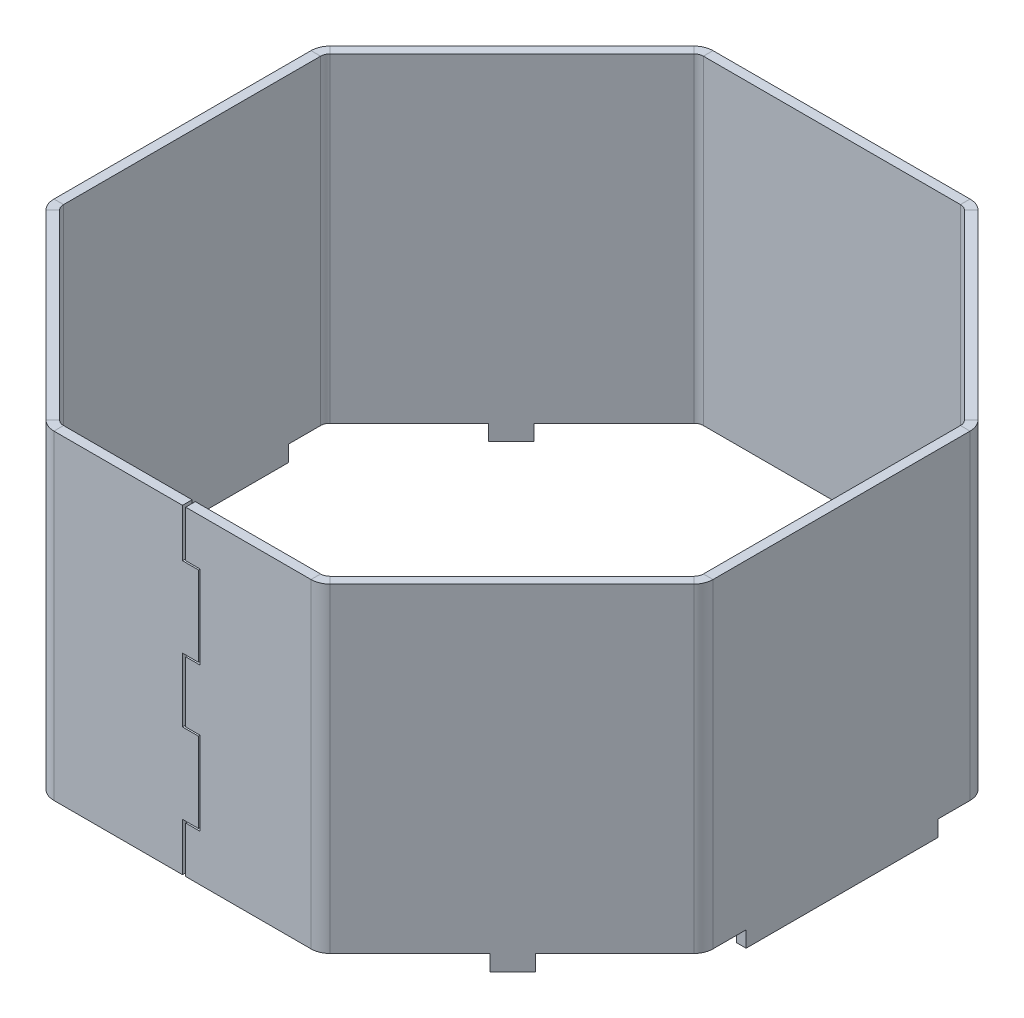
ISO-10303-21;
HEADER;
FILE_DESCRIPTION(('STEP AP214'),'2;1');
FILE_NAME('part.step','',(''),(''),'','','');
FILE_SCHEMA(('AUTOMOTIVE_DESIGN { 1 0 10303 214 1 1 1 1 }'));
ENDSEC;
DATA;
#1=APPLICATION_CONTEXT('core data for automotive mechanical design processes');
#2=APPLICATION_PROTOCOL_DEFINITION('international standard','automotive_design',2000,#1);
#3=PRODUCT_CONTEXT('',#1,'mechanical');
#4=PRODUCT('Part','Part','',(#3));
#5=PRODUCT_RELATED_PRODUCT_CATEGORY('part','',(#4));
#6=PRODUCT_DEFINITION_FORMATION('','',#4);
#7=PRODUCT_DEFINITION_CONTEXT('part definition',#1,'design');
#8=PRODUCT_DEFINITION('design','',#6,#7);
#9=PRODUCT_DEFINITION_SHAPE('','',#8);
#10=(LENGTH_UNIT() NAMED_UNIT(*) SI_UNIT(.MILLI.,.METRE.));
#11=(NAMED_UNIT(*) PLANE_ANGLE_UNIT() SI_UNIT($,.RADIAN.));
#12=(NAMED_UNIT(*) SI_UNIT($,.STERADIAN.) SOLID_ANGLE_UNIT());
#13=UNCERTAINTY_MEASURE_WITH_UNIT(LENGTH_MEASURE(1.E-05),#10,'distance_accuracy_value','');
#14=(GEOMETRIC_REPRESENTATION_CONTEXT(3) GLOBAL_UNCERTAINTY_ASSIGNED_CONTEXT((#13)) GLOBAL_UNIT_ASSIGNED_CONTEXT((#10,
#11,#12)) REPRESENTATION_CONTEXT('',''));
#15=CARTESIAN_POINT('',(0.,0.,0.));
#16=DIRECTION('',(0.,0.,1.));
#17=DIRECTION('',(1.,0.,0.));
#18=AXIS2_PLACEMENT_3D('',#15,#16,#17);
#19=CARTESIAN_POINT('',(101.242640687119,0.,-44.4213562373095));
#20=DIRECTION('',(0.,-1.,0.));
#21=DIRECTION('',(0.,0.,-1.));
#22=AXIS2_PLACEMENT_3D('',#19,#20,#21);
#23=PLANE('',#22);
#24=DIRECTION('',(0.,0.,-1.));
#25=VECTOR('',#24,1.);
#26=CARTESIAN_POINT('',(103.,0.,41.4213562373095));
#27=LINE('',#26,#25);
#28=CARTESIAN_POINT('',(103.,0.,-30.1787155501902));
#29=VERTEX_POINT('',#28);
#30=CARTESIAN_POINT('',(103.,0.,-40.1787155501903));
#31=VERTEX_POINT('',#30);
#32=EDGE_CURVE('E606',#29,#31,#27,.T.);
#33=ORIENTED_EDGE('',*,*,#32,.F.);
#34=CARTESIAN_POINT('',(103.,0.,-30.1787155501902));
#35=CARTESIAN_POINT('',(100.,0.,-30.1787155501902));
#36=B_SPLINE_CURVE_WITH_KNOTS('',1,(#34,#35),.UNSPECIFIED.,.F.,.F.,(2,2),(0.,
0.0238095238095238),.UNSPECIFIED.);
#37=CARTESIAN_POINT('',(100.,0.,-30.1787155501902));
#38=VERTEX_POINT('',#37);
#39=EDGE_CURVE('E593',#29,#38,#36,.T.);
#40=ORIENTED_EDGE('',*,*,#39,.T.);
#41=DIRECTION('',(0.,0.,-1.));
#42=VECTOR('',#41,1.);
#43=CARTESIAN_POINT('',(100.,0.,41.4213562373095));
#44=LINE('',#43,#42);
#45=CARTESIAN_POINT('',(100.,0.,-40.1787155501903));
#46=VERTEX_POINT('',#45);
#47=EDGE_CURVE('E604',#38,#46,#44,.T.);
#48=ORIENTED_EDGE('',*,*,#47,.T.);
#49=DIRECTION('',(1.,0.,0.));
#50=VECTOR('',#49,1.);
#51=CARTESIAN_POINT('',(100.,0.,-40.1787155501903));
#52=LINE('',#51,#50);
#53=EDGE_CURVE('E828',#46,#31,#52,.T.);
#54=ORIENTED_EDGE('',*,*,#53,.T.);
#55=EDGE_LOOP('',(#33,#40,#48,#54));
#56=FACE_BOUND('',#55,.T.);
#57=ADVANCED_FACE('F116',(#56),#23,.T.);
#58=CARTESIAN_POINT('',(100.,0.,40.1787155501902));
#59=VERTEX_POINT('',#58);
#60=CARTESIAN_POINT('',(100.,0.,29.8212844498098));
#61=VERTEX_POINT('',#60);
#62=EDGE_CURVE('E616',#59,#61,#44,.T.);
#63=ORIENTED_EDGE('',*,*,#62,.T.);
#64=CARTESIAN_POINT('',(100.,0.,29.8212844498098));
#65=CARTESIAN_POINT('',(103.,0.,29.8212844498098));
#66=B_SPLINE_CURVE_WITH_KNOTS('',1,(#64,#65),.UNSPECIFIED.,.F.,.F.,(2,2),(0.5,
0.523809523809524),.UNSPECIFIED.);
#67=CARTESIAN_POINT('',(103.,0.,29.8212844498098));
#68=VERTEX_POINT('',#67);
#69=EDGE_CURVE('E607',#61,#68,#66,.T.);
#70=ORIENTED_EDGE('',*,*,#69,.T.);
#71=CARTESIAN_POINT('',(103.,0.,40.1787155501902));
#72=VERTEX_POINT('',#71);
#73=EDGE_CURVE('E654',#72,#68,#27,.T.);
#74=ORIENTED_EDGE('',*,*,#73,.F.);
#75=DIRECTION('',(-1.,0.,0.));
#76=VECTOR('',#75,1.);
#77=CARTESIAN_POINT('',(103.,0.,40.1787155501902));
#78=LINE('',#77,#76);
#79=EDGE_CURVE('E817',#72,#59,#78,.T.);
#80=ORIENTED_EDGE('',*,*,#79,.T.);
#81=EDGE_LOOP('',(#63,#70,#74,#80));
#82=FACE_BOUND('',#81,.T.);
#83=ADVANCED_FACE('F1520',(#82),#23,.T.);
#84=CARTESIAN_POINT('',(-101.242640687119,0.,44.4213562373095));
#85=DIRECTION('',(0.,-1.,0.));
#86=DIRECTION('',(0.,0.,-1.));
#87=AXIS2_PLACEMENT_3D('',#84,#85,#86);
#88=PLANE('',#87);
#89=CARTESIAN_POINT('',(-103.,0.,-30.1787155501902));
#90=CARTESIAN_POINT('',(-100.,0.,-30.1787155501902));
#91=B_SPLINE_CURVE_WITH_KNOTS('',1,(#89,#90),.UNSPECIFIED.,.F.,.F.,(2,2),(0.,
0.0238095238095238),.UNSPECIFIED.);
#92=CARTESIAN_POINT('',(-103.,0.,-30.1787155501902));
#93=VERTEX_POINT('',#92);
#94=CARTESIAN_POINT('',(-100.,0.,-30.1787155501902));
#95=VERTEX_POINT('',#94);
#96=EDGE_CURVE('E1797',#93,#95,#91,.T.);
#97=ORIENTED_EDGE('',*,*,#96,.F.);
#98=DIRECTION('',(0.,0.,1.));
#99=VECTOR('',#98,1.);
#100=CARTESIAN_POINT('',(-103.,0.,-41.4213562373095));
#101=LINE('',#100,#99);
#102=CARTESIAN_POINT('',(-103.,0.,-40.1787155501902));
#103=VERTEX_POINT('',#102);
#104=EDGE_CURVE('E681',#103,#93,#101,.T.);
#105=ORIENTED_EDGE('',*,*,#104,.F.);
#106=DIRECTION('',(1.,0.,0.));
#107=VECTOR('',#106,1.);
#108=CARTESIAN_POINT('',(-103.,0.,-40.1787155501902));
#109=LINE('',#108,#107);
#110=CARTESIAN_POINT('',(-100.,0.,-40.1787155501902));
#111=VERTEX_POINT('',#110);
#112=EDGE_CURVE('E851',#103,#111,#109,.T.);
#113=ORIENTED_EDGE('',*,*,#112,.T.);
#114=DIRECTION('',(0.,0.,1.));
#115=VECTOR('',#114,1.);
#116=CARTESIAN_POINT('',(-100.,0.,-41.4213562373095));
#117=LINE('',#116,#115);
#118=EDGE_CURVE('E1091',#111,#95,#117,.T.);
#119=ORIENTED_EDGE('',*,*,#118,.T.);
#120=EDGE_LOOP('',(#97,#105,#113,#119));
#121=FACE_BOUND('',#120,.T.);
#122=ADVANCED_FACE('F1525',(#121),#88,.T.);
#123=CARTESIAN_POINT('',(-103.,0.,-40.1787155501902));
#124=DIRECTION('',(0.,-1.,0.));
#125=DIRECTION('',(0.,0.,-1.));
#126=AXIS2_PLACEMENT_3D('',#123,#124,#125);
#127=PLANE('',#126);
#128=DIRECTION('',(-0.707106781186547,0.,0.707106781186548));
#129=VECTOR('',#128,1.);
#130=CARTESIAN_POINT('',(-43.5426765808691,0.,-102.12132034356));
#131=LINE('',#130,#129);
#132=CARTESIAN_POINT('',(-76.4939033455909,0.,-69.1700935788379));
#133=VERTEX_POINT('',#132);
#134=CARTESIAN_POINT('',(-101.242640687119,0.,-44.4213562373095));
#135=VERTEX_POINT('',#134);
#136=EDGE_CURVE('E673',#133,#135,#131,.T.);
#137=ORIENTED_EDGE('',*,*,#136,.F.);
#138=CARTESIAN_POINT('',(-76.4939033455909,0.,-69.1700935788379));
#139=CARTESIAN_POINT('',(-74.3725830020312,0.,-67.0487732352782));
#140=B_SPLINE_CURVE_WITH_KNOTS('',1,(#138,#139),.UNSPECIFIED.,.F.,.F.,(2,2),(0.,
0.115384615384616),.UNSPECIFIED.);
#141=CARTESIAN_POINT('',(-74.3725830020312,0.,-67.0487732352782));
#142=VERTEX_POINT('',#141);
#143=EDGE_CURVE('E1763',#133,#142,#140,.T.);
#144=ORIENTED_EDGE('',*,*,#143,.T.);
#145=DIRECTION('',(-0.707106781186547,0.,0.707106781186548));
#146=VECTOR('',#145,1.);
#147=CARTESIAN_POINT('',(-41.4213562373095,0.,-100.));
#148=LINE('',#147,#146);
#149=CARTESIAN_POINT('',(-99.1213203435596,0.,-42.3000358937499));
#150=VERTEX_POINT('',#149);
#151=EDGE_CURVE('E1096',#142,#150,#148,.T.);
#152=ORIENTED_EDGE('',*,*,#151,.T.);
#153=DIRECTION('',(-0.707106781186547,0.,-0.707106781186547));
#154=VECTOR('',#153,1.);
#155=CARTESIAN_POINT('',(-99.1213203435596,0.,-42.3000358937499));
#156=LINE('',#155,#154);
#157=EDGE_CURVE('E853',#150,#135,#156,.T.);
#158=ORIENTED_EDGE('',*,*,#157,.T.);
#159=EDGE_LOOP('',(#137,#144,#152,#158));
#160=FACE_BOUND('',#159,.T.);
#161=ADVANCED_FACE('F1562',(#160),#127,.T.);
#162=CARTESIAN_POINT('',(-42.3000358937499,0.,-99.1213203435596));
#163=VERTEX_POINT('',#162);
#164=CARTESIAN_POINT('',(-67.3015151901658,0.,-74.1198410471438));
#165=VERTEX_POINT('',#164);
#166=EDGE_CURVE('E1097',#163,#165,#148,.T.);
#167=ORIENTED_EDGE('',*,*,#166,.T.);
#168=CARTESIAN_POINT('',(-67.3015151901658,0.,-74.1198410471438));
#169=CARTESIAN_POINT('',(-69.4228355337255,0.,-76.2411613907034));
#170=B_SPLINE_CURVE_WITH_KNOTS('',1,(#168,#169),.UNSPECIFIED.,.F.,.F.,(2,2),(0.5,
0.615384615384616),.UNSPECIFIED.);
#171=CARTESIAN_POINT('',(-69.4228355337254,0.,-76.2411613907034));
#172=VERTEX_POINT('',#171);
#173=EDGE_CURVE('E1752',#165,#172,#170,.T.);
#174=ORIENTED_EDGE('',*,*,#173,.T.);
#175=CARTESIAN_POINT('',(-44.4213562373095,0.,-101.242640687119));
#176=VERTEX_POINT('',#175);
#177=EDGE_CURVE('E674',#176,#172,#131,.T.);
#178=ORIENTED_EDGE('',*,*,#177,.F.);
#179=DIRECTION('',(0.707106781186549,0.,0.707106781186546));
#180=VECTOR('',#179,1.);
#181=CARTESIAN_POINT('',(-44.4213562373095,0.,-101.242640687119));
#182=LINE('',#181,#180);
#183=EDGE_CURVE('E843',#176,#163,#182,.T.);
#184=ORIENTED_EDGE('',*,*,#183,.T.);
#185=EDGE_LOOP('',(#167,#174,#178,#184));
#186=FACE_BOUND('',#185,.T.);
#187=ADVANCED_FACE('F1544',(#186),#127,.T.);
#188=CARTESIAN_POINT('',(40.1787155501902,0.,-103.));
#189=DIRECTION('',(0.,-1.,0.));
#190=DIRECTION('',(0.,0.,-1.));
#191=AXIS2_PLACEMENT_3D('',#188,#189,#190);
#192=PLANE('',#191);
#193=DIRECTION('',(-0.707106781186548,0.,-0.707106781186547));
#194=VECTOR('',#193,1.);
#195=CARTESIAN_POINT('',(102.12132034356,0.,-43.5426765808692));
#196=LINE('',#195,#194);
#197=CARTESIAN_POINT('',(69.1700935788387,0.,-76.4939033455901));
#198=VERTEX_POINT('',#197);
#199=CARTESIAN_POINT('',(44.4213562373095,0.,-101.242640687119));
#200=VERTEX_POINT('',#199);
#201=EDGE_CURVE('E660',#198,#200,#196,.T.);
#202=ORIENTED_EDGE('',*,*,#201,.F.);
#203=CARTESIAN_POINT('',(69.1700935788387,0.,-76.4939033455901));
#204=CARTESIAN_POINT('',(67.048773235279,0.,-74.3725830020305));
#205=B_SPLINE_CURVE_WITH_KNOTS('',1,(#203,#204),.UNSPECIFIED.,.F.,.F.,(2,2),(0.,
0.115384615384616),.UNSPECIFIED.);
#206=CARTESIAN_POINT('',(67.048773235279,0.,-74.3725830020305));
#207=VERTEX_POINT('',#206);
#208=EDGE_CURVE('E1120',#198,#207,#205,.T.);
#209=ORIENTED_EDGE('',*,*,#208,.T.);
#210=DIRECTION('',(-0.707106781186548,0.,-0.707106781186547));
#211=VECTOR('',#210,1.);
#212=CARTESIAN_POINT('',(100.,0.,-41.4213562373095));
#213=LINE('',#212,#211);
#214=CARTESIAN_POINT('',(42.3000358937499,0.,-99.1213203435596));
#215=VERTEX_POINT('',#214);
#216=EDGE_CURVE('E1108',#207,#215,#213,.T.);
#217=ORIENTED_EDGE('',*,*,#216,.T.);
#218=DIRECTION('',(0.70710678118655,0.,-0.707106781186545));
#219=VECTOR('',#218,1.);
#220=CARTESIAN_POINT('',(42.3000358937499,0.,-99.1213203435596));
#221=LINE('',#220,#219);
#222=EDGE_CURVE('E836',#215,#200,#221,.T.);
#223=ORIENTED_EDGE('',*,*,#222,.T.);
#224=EDGE_LOOP('',(#202,#209,#217,#223));
#225=FACE_BOUND('',#224,.T.);
#226=ADVANCED_FACE('F1118',(#225),#192,.T.);
#227=CARTESIAN_POINT('',(99.1213203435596,0.,-42.3000358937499));
#228=VERTEX_POINT('',#227);
#229=CARTESIAN_POINT('',(74.1198410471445,0.,-67.301515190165));
#230=VERTEX_POINT('',#229);
#231=EDGE_CURVE('E622',#228,#230,#213,.T.);
#232=ORIENTED_EDGE('',*,*,#231,.T.);
#233=CARTESIAN_POINT('',(74.1198410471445,0.,-67.301515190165));
#234=CARTESIAN_POINT('',(76.2411613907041,0.,-69.4228355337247));
#235=B_SPLINE_CURVE_WITH_KNOTS('',1,(#233,#234),.UNSPECIFIED.,.F.,.F.,(2,2),(0.5,
0.615384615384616),.UNSPECIFIED.);
#236=CARTESIAN_POINT('',(76.2411613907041,0.,-69.4228355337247));
#237=VERTEX_POINT('',#236);
#238=EDGE_CURVE('E1175',#230,#237,#235,.T.);
#239=ORIENTED_EDGE('',*,*,#238,.T.);
#240=CARTESIAN_POINT('',(101.242640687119,0.,-44.4213562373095));
#241=VERTEX_POINT('',#240);
#242=EDGE_CURVE('E661',#241,#237,#196,.T.);
#243=ORIENTED_EDGE('',*,*,#242,.F.);
#244=DIRECTION('',(-0.707106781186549,0.,0.707106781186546));
#245=VECTOR('',#244,1.);
#246=CARTESIAN_POINT('',(101.242640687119,0.,-44.4213562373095));
#247=LINE('',#246,#245);
#248=EDGE_CURVE('E826',#241,#228,#247,.T.);
#249=ORIENTED_EDGE('',*,*,#248,.T.);
#250=EDGE_LOOP('',(#232,#239,#243,#249));
#251=FACE_BOUND('',#250,.T.);
#252=ADVANCED_FACE('F1543',(#251),#192,.T.);
#253=CARTESIAN_POINT('',(103.,0.,40.1787155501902));
#254=DIRECTION('',(0.,-1.,0.));
#255=DIRECTION('',(0.,0.,-1.));
#256=AXIS2_PLACEMENT_3D('',#253,#254,#255);
#257=PLANE('',#256);
#258=DIRECTION('',(0.707106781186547,0.,-0.707106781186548));
#259=VECTOR('',#258,1.);
#260=CARTESIAN_POINT('',(43.5426765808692,0.,102.12132034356));
#261=LINE('',#260,#259);
#262=CARTESIAN_POINT('',(76.4939033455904,0.,69.1700935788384));
#263=VERTEX_POINT('',#262);
#264=CARTESIAN_POINT('',(101.242640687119,0.,44.4213562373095));
#265=VERTEX_POINT('',#264);
#266=EDGE_CURVE('E647',#263,#265,#261,.T.);
#267=ORIENTED_EDGE('',*,*,#266,.F.);
#268=CARTESIAN_POINT('',(76.4939033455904,0.,69.1700935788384));
#269=CARTESIAN_POINT('',(74.3725830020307,0.,67.0487732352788));
#270=B_SPLINE_CURVE_WITH_KNOTS('',1,(#268,#269),.UNSPECIFIED.,.F.,.F.,(2,2),(0.,
0.115384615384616),.UNSPECIFIED.);
#271=CARTESIAN_POINT('',(74.3725830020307,0.,67.0487732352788));
#272=VERTEX_POINT('',#271);
#273=EDGE_CURVE('E1201',#263,#272,#270,.T.);
#274=ORIENTED_EDGE('',*,*,#273,.T.);
#275=DIRECTION('',(0.707106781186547,0.,-0.707106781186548));
#276=VECTOR('',#275,1.);
#277=CARTESIAN_POINT('',(41.4213562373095,0.,100.));
#278=LINE('',#277,#276);
#279=CARTESIAN_POINT('',(99.1213203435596,0.,42.3000358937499));
#280=VERTEX_POINT('',#279);
#281=EDGE_CURVE('E628',#272,#280,#278,.T.);
#282=ORIENTED_EDGE('',*,*,#281,.T.);
#283=DIRECTION('',(0.707106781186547,0.,0.707106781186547));
#284=VECTOR('',#283,1.);
#285=CARTESIAN_POINT('',(99.1213203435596,0.,42.3000358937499));
#286=LINE('',#285,#284);
#287=EDGE_CURVE('E819',#280,#265,#286,.T.);
#288=ORIENTED_EDGE('',*,*,#287,.T.);
#289=EDGE_LOOP('',(#267,#274,#282,#288));
#290=FACE_BOUND('',#289,.T.);
#291=ADVANCED_FACE('F1680',(#290),#257,.T.);
#292=CARTESIAN_POINT('',(42.3000358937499,0.,99.1213203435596));
#293=VERTEX_POINT('',#292);
#294=CARTESIAN_POINT('',(67.3015151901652,0.,74.1198410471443));
#295=VERTEX_POINT('',#294);
#296=EDGE_CURVE('E629',#293,#295,#278,.T.);
#297=ORIENTED_EDGE('',*,*,#296,.T.);
#298=CARTESIAN_POINT('',(67.3015151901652,0.,74.1198410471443));
#299=CARTESIAN_POINT('',(69.4228355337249,0.,76.2411613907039));
#300=B_SPLINE_CURVE_WITH_KNOTS('',1,(#298,#299),.UNSPECIFIED.,.F.,.F.,(2,2),(0.5,
0.615384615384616),.UNSPECIFIED.);
#301=CARTESIAN_POINT('',(69.4228355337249,0.,76.2411613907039));
#302=VERTEX_POINT('',#301);
#303=EDGE_CURVE('E1214',#295,#302,#300,.T.);
#304=ORIENTED_EDGE('',*,*,#303,.T.);
#305=CARTESIAN_POINT('',(44.4213562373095,0.,101.242640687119));
#306=VERTEX_POINT('',#305);
#307=EDGE_CURVE('E648',#306,#302,#261,.T.);
#308=ORIENTED_EDGE('',*,*,#307,.F.);
#309=DIRECTION('',(-0.707106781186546,0.,-0.707106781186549));
#310=VECTOR('',#309,1.);
#311=CARTESIAN_POINT('',(44.4213562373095,0.,101.242640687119));
#312=LINE('',#311,#310);
#313=EDGE_CURVE('E808',#306,#293,#312,.T.);
#314=ORIENTED_EDGE('',*,*,#313,.T.);
#315=EDGE_LOOP('',(#297,#304,#308,#314));
#316=FACE_BOUND('',#315,.T.);
#317=ADVANCED_FACE('F1589',(#316),#257,.T.);
#318=CARTESIAN_POINT('',(-40.1787155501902,0.,103.));
#319=DIRECTION('',(0.,-1.,0.));
#320=DIRECTION('',(0.,0.,-1.));
#321=AXIS2_PLACEMENT_3D('',#318,#319,#320);
#322=PLANE('',#321);
#323=DIRECTION('',(0.707106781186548,0.,0.707106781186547));
#324=VECTOR('',#323,1.);
#325=CARTESIAN_POINT('',(-102.12132034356,0.,43.5426765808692));
#326=LINE('',#325,#324);
#327=CARTESIAN_POINT('',(-69.1700935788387,0.,76.4939033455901));
#328=VERTEX_POINT('',#327);
#329=CARTESIAN_POINT('',(-44.4213562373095,0.,101.242640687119));
#330=VERTEX_POINT('',#329);
#331=EDGE_CURVE('E687',#328,#330,#326,.T.);
#332=ORIENTED_EDGE('',*,*,#331,.F.);
#333=CARTESIAN_POINT('',(-69.1700935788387,0.,76.4939033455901));
#334=CARTESIAN_POINT('',(-67.048773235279,0.,74.3725830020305));
#335=B_SPLINE_CURVE_WITH_KNOTS('',1,(#333,#334),.UNSPECIFIED.,.F.,.F.,(2,2),(0.,
0.115384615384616),.UNSPECIFIED.);
#336=CARTESIAN_POINT('',(-67.048773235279,0.,74.3725830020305));
#337=VERTEX_POINT('',#336);
#338=EDGE_CURVE('E1233',#328,#337,#335,.T.);
#339=ORIENTED_EDGE('',*,*,#338,.T.);
#340=DIRECTION('',(0.707106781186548,0.,0.707106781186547));
#341=VECTOR('',#340,1.);
#342=CARTESIAN_POINT('',(-100.,0.,41.4213562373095));
#343=LINE('',#342,#341);
#344=CARTESIAN_POINT('',(-42.3000358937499,0.,99.1213203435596));
#345=VERTEX_POINT('',#344);
#346=EDGE_CURVE('E1083',#337,#345,#343,.T.);
#347=ORIENTED_EDGE('',*,*,#346,.T.);
#348=DIRECTION('',(-0.707106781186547,0.,0.707106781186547));
#349=VECTOR('',#348,1.);
#350=CARTESIAN_POINT('',(-42.3000358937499,0.,99.1213203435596));
#351=LINE('',#350,#349);
#352=EDGE_CURVE('E871',#345,#330,#351,.T.);
#353=ORIENTED_EDGE('',*,*,#352,.T.);
#354=EDGE_LOOP('',(#332,#339,#347,#353));
#355=FACE_BOUND('',#354,.T.);
#356=ADVANCED_FACE('F1585',(#355),#322,.T.);
#357=CARTESIAN_POINT('',(-99.1213203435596,0.,42.3000358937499));
#358=VERTEX_POINT('',#357);
#359=CARTESIAN_POINT('',(-74.1198410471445,0.,67.301515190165));
#360=VERTEX_POINT('',#359);
#361=EDGE_CURVE('E1084',#358,#360,#343,.T.);
#362=ORIENTED_EDGE('',*,*,#361,.T.);
#363=CARTESIAN_POINT('',(-74.1198410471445,0.,67.301515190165));
#364=CARTESIAN_POINT('',(-76.2411613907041,0.,69.4228355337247));
#365=B_SPLINE_CURVE_WITH_KNOTS('',1,(#363,#364),.UNSPECIFIED.,.F.,.F.,(2,2),(0.5,
0.615384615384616),.UNSPECIFIED.);
#366=CARTESIAN_POINT('',(-76.2411613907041,0.,69.4228355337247));
#367=VERTEX_POINT('',#366);
#368=EDGE_CURVE('E1246',#360,#367,#365,.T.);
#369=ORIENTED_EDGE('',*,*,#368,.T.);
#370=CARTESIAN_POINT('',(-101.242640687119,0.,44.4213562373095));
#371=VERTEX_POINT('',#370);
#372=EDGE_CURVE('E688',#371,#367,#326,.T.);
#373=ORIENTED_EDGE('',*,*,#372,.F.);
#374=DIRECTION('',(0.707106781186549,0.,-0.707106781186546));
#375=VECTOR('',#374,1.);
#376=CARTESIAN_POINT('',(-101.242640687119,0.,44.4213562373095));
#377=LINE('',#376,#375);
#378=EDGE_CURVE('E860',#371,#358,#377,.T.);
#379=ORIENTED_EDGE('',*,*,#378,.T.);
#380=EDGE_LOOP('',(#362,#369,#373,#379));
#381=FACE_BOUND('',#380,.T.);
#382=ADVANCED_FACE('F1588',(#381),#322,.T.);
#383=CARTESIAN_POINT('',(0.,100.,100.));
#384=DIRECTION('',(1.,0.,0.));
#385=DIRECTION('',(0.,0.,-1.));
#386=AXIS2_PLACEMENT_3D('',#383,#384,#385);
#387=PLANE('',#386);
#388=CARTESIAN_POINT('',(0.,40.,100.));
#389=CARTESIAN_POINT('',(0.,40.,103.));
#390=B_SPLINE_CURVE_WITH_KNOTS('',1,(#388,#389),.UNSPECIFIED.,.F.,.F.,(2,2),(0.,
0.0535714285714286),.UNSPECIFIED.);
#391=CARTESIAN_POINT('',(0.,40.,100.));
#392=VERTEX_POINT('',#391);
#393=CARTESIAN_POINT('',(0.,40.,103.));
#394=VERTEX_POINT('',#393);
#395=EDGE_CURVE('E1265',#392,#394,#390,.T.);
#396=ORIENTED_EDGE('',*,*,#395,.F.);
#397=DIRECTION('',(0.,-1.,0.));
#398=VECTOR('',#397,1.);
#399=CARTESIAN_POINT('',(0.,100.,100.));
#400=LINE('',#399,#398);
#401=CARTESIAN_POINT('',(0.,60.,100.));
#402=VERTEX_POINT('',#401);
#403=EDGE_CURVE('E805',#402,#392,#400,.T.);
#404=ORIENTED_EDGE('',*,*,#403,.F.);
#405=CARTESIAN_POINT('',(0.,60.,103.));
#406=CARTESIAN_POINT('',(0.,60.,100.));
#407=B_SPLINE_CURVE_WITH_KNOTS('',1,(#405,#406),.UNSPECIFIED.,.F.,.F.,(2,2),(0.5,
0.553571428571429),.UNSPECIFIED.);
#408=CARTESIAN_POINT('',(0.,60.,103.));
#409=VERTEX_POINT('',#408);
#410=EDGE_CURVE('E1329',#409,#402,#407,.T.);
#411=ORIENTED_EDGE('',*,*,#410,.F.);
#412=DIRECTION('',(0.,-1.,0.));
#413=VECTOR('',#412,1.);
#414=CARTESIAN_POINT('',(0.,100.,103.));
#415=LINE('',#414,#413);
#416=EDGE_CURVE('E809',#409,#394,#415,.T.);
#417=ORIENTED_EDGE('',*,*,#416,.T.);
#418=EDGE_LOOP('',(#396,#404,#411,#417));
#419=FACE_BOUND('',#418,.T.);
#420=ADVANCED_FACE('F1493',(#419),#387,.T.);
#421=CARTESIAN_POINT('',(0.,85.,100.));
#422=CARTESIAN_POINT('',(0.,85.,103.));
#423=B_SPLINE_CURVE_WITH_KNOTS('',1,(#421,#422),.UNSPECIFIED.,.F.,.F.,(2,2),(0.,
0.0535714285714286),.UNSPECIFIED.);
#424=CARTESIAN_POINT('',(0.,85.,100.));
#425=VERTEX_POINT('',#424);
#426=CARTESIAN_POINT('',(0.,85.,103.));
#427=VERTEX_POINT('',#426);
#428=EDGE_CURVE('E1322',#425,#427,#423,.T.);
#429=ORIENTED_EDGE('',*,*,#428,.F.);
#430=CARTESIAN_POINT('',(0.,100.,100.));
#431=VERTEX_POINT('',#430);
#432=EDGE_CURVE('E801',#431,#425,#400,.T.);
#433=ORIENTED_EDGE('',*,*,#432,.F.);
#434=DIRECTION('',(0.,0.,1.));
#435=VECTOR('',#434,1.);
#436=CARTESIAN_POINT('',(0.,100.,100.));
#437=LINE('',#436,#435);
#438=CARTESIAN_POINT('',(0.,100.,103.));
#439=VERTEX_POINT('',#438);
#440=EDGE_CURVE('E969',#431,#439,#437,.T.);
#441=ORIENTED_EDGE('',*,*,#440,.T.);
#442=EDGE_CURVE('E806',#439,#427,#415,.T.);
#443=ORIENTED_EDGE('',*,*,#442,.T.);
#444=EDGE_LOOP('',(#429,#433,#441,#443));
#445=FACE_BOUND('',#444,.T.);
#446=ADVANCED_FACE('F1388',(#445),#387,.T.);
#447=CARTESIAN_POINT('',(1.00000000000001,100.,100.));
#448=DIRECTION('',(0.,0.,-1.));
#449=DIRECTION('',(-1.,0.,0.));
#450=AXIS2_PLACEMENT_3D('',#447,#448,#449);
#451=PLANE('',#450);
#452=DIRECTION('',(0.,1.,0.));
#453=VECTOR('',#452,1.);
#454=CARTESIAN_POINT('',(5.50800000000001,100.,100.));
#455=LINE('',#454,#453);
#456=CARTESIAN_POINT('',(5.50800000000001,59.492,100.));
#457=VERTEX_POINT('',#456);
#458=CARTESIAN_POINT('',(5.50800000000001,85.508,100.));
#459=VERTEX_POINT('',#458);
#460=EDGE_CURVE('E959',#457,#459,#455,.T.);
#461=ORIENTED_EDGE('',*,*,#460,.T.);
#462=DIRECTION('',(-1.,0.,0.));
#463=VECTOR('',#462,1.);
#464=CARTESIAN_POINT('',(1.00000000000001,85.508,100.));
#465=LINE('',#464,#463);
#466=CARTESIAN_POINT('',(1.00000000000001,85.508,100.));
#467=VERTEX_POINT('',#466);
#468=EDGE_CURVE('E911',#459,#467,#465,.T.);
#469=ORIENTED_EDGE('',*,*,#468,.T.);
#470=DIRECTION('',(0.,-1.,0.));
#471=VECTOR('',#470,1.);
#472=CARTESIAN_POINT('',(1.00000000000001,100.,100.));
#473=LINE('',#472,#471);
#474=CARTESIAN_POINT('',(1.00000000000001,100.,100.));
#475=VERTEX_POINT('',#474);
#476=EDGE_CURVE('E750',#475,#467,#473,.T.);
#477=ORIENTED_EDGE('',*,*,#476,.F.);
#478=DIRECTION('',(1.,0.,0.));
#479=VECTOR('',#478,1.);
#480=CARTESIAN_POINT('',(1.00000000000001,100.,100.));
#481=LINE('',#480,#479);
#482=CARTESIAN_POINT('',(40.1787155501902,100.,100.));
#483=VERTEX_POINT('',#482);
#484=EDGE_CURVE('E1019',#475,#483,#481,.T.);
#485=ORIENTED_EDGE('',*,*,#484,.T.);
#486=DIRECTION('',(0.,-1.,0.));
#487=VECTOR('',#486,1.);
#488=CARTESIAN_POINT('',(40.1787155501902,100.,100.));
#489=LINE('',#488,#487);
#490=CARTESIAN_POINT('',(40.1787155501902,0.,100.));
#491=VERTEX_POINT('',#490);
#492=EDGE_CURVE('E753',#483,#491,#489,.T.);
#493=ORIENTED_EDGE('',*,*,#492,.T.);
#494=DIRECTION('',(1.,0.,0.));
#495=VECTOR('',#494,1.);
#496=CARTESIAN_POINT('',(1.00000000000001,0.,100.));
#497=LINE('',#496,#495);
#498=CARTESIAN_POINT('',(1.00000000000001,0.,100.));
#499=VERTEX_POINT('',#498);
#500=EDGE_CURVE('E635',#499,#491,#497,.T.);
#501=ORIENTED_EDGE('',*,*,#500,.F.);
#502=CARTESIAN_POINT('',(1.00000000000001,14.492,100.));
#503=VERTEX_POINT('',#502);
#504=EDGE_CURVE('E748',#503,#499,#473,.T.);
#505=ORIENTED_EDGE('',*,*,#504,.F.);
#506=DIRECTION('',(1.,0.,0.));
#507=VECTOR('',#506,1.);
#508=CARTESIAN_POINT('',(1.00000000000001,14.492,100.));
#509=LINE('',#508,#507);
#510=CARTESIAN_POINT('',(5.50800000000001,14.492,100.));
#511=VERTEX_POINT('',#510);
#512=EDGE_CURVE('E950',#503,#511,#509,.T.);
#513=ORIENTED_EDGE('',*,*,#512,.T.);
#514=DIRECTION('',(0.,1.,0.));
#515=VECTOR('',#514,1.);
#516=CARTESIAN_POINT('',(5.50800000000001,100.,100.));
#517=LINE('',#516,#515);
#518=CARTESIAN_POINT('',(5.50800000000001,40.508,100.));
#519=VERTEX_POINT('',#518);
#520=EDGE_CURVE('E914',#511,#519,#517,.T.);
#521=ORIENTED_EDGE('',*,*,#520,.T.);
#522=DIRECTION('',(-1.,0.,0.));
#523=VECTOR('',#522,1.);
#524=CARTESIAN_POINT('',(1.00000000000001,40.508,100.));
#525=LINE('',#524,#523);
#526=CARTESIAN_POINT('',(1.00000000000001,40.508,100.));
#527=VERTEX_POINT('',#526);
#528=EDGE_CURVE('E956',#519,#527,#525,.T.);
#529=ORIENTED_EDGE('',*,*,#528,.T.);
#530=CARTESIAN_POINT('',(1.00000000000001,59.492,100.));
#531=VERTEX_POINT('',#530);
#532=EDGE_CURVE('E754',#531,#527,#473,.T.);
#533=ORIENTED_EDGE('',*,*,#532,.F.);
#534=DIRECTION('',(1.,0.,0.));
#535=VECTOR('',#534,1.);
#536=CARTESIAN_POINT('',(1.00000000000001,59.492,100.));
#537=LINE('',#536,#535);
#538=EDGE_CURVE('E962',#531,#457,#537,.T.);
#539=ORIENTED_EDGE('',*,*,#538,.T.);
#540=EDGE_LOOP('',(#461,#469,#477,#485,#493,#501,#505,#513,#521,#529,#533,#539));
#541=FACE_BOUND('',#540,.T.);
#542=ADVANCED_FACE('F1614',(#541),#451,.T.);
#543=CARTESIAN_POINT('',(1.00000000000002,100.,103.));
#544=DIRECTION('',(-1.,0.,0.));
#545=DIRECTION('',(0.,0.,1.));
#546=AXIS2_PLACEMENT_3D('',#543,#544,#545);
#547=PLANE('',#546);
#548=ORIENTED_EDGE('',*,*,#476,.T.);
#549=DIRECTION('',(0.,0.,1.));
#550=VECTOR('',#549,1.);
#551=CARTESIAN_POINT('',(1.00000000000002,85.508,103.));
#552=LINE('',#551,#550);
#553=CARTESIAN_POINT('',(1.00000000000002,85.508,103.));
#554=VERTEX_POINT('',#553);
#555=EDGE_CURVE('E964',#467,#554,#552,.T.);
#556=ORIENTED_EDGE('',*,*,#555,.T.);
#557=DIRECTION('',(0.,-1.,0.));
#558=VECTOR('',#557,1.);
#559=CARTESIAN_POINT('',(1.00000000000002,100.,103.));
#560=LINE('',#559,#558);
#561=CARTESIAN_POINT('',(1.00000000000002,100.,103.));
#562=VERTEX_POINT('',#561);
#563=EDGE_CURVE('E745',#562,#554,#560,.T.);
#564=ORIENTED_EDGE('',*,*,#563,.F.);
#565=DIRECTION('',(0.,0.,-1.));
#566=VECTOR('',#565,1.);
#567=CARTESIAN_POINT('',(1.00000000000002,100.,103.));
#568=LINE('',#567,#566);
#569=EDGE_CURVE('E1022',#562,#475,#568,.T.);
#570=ORIENTED_EDGE('',*,*,#569,.T.);
#571=EDGE_LOOP('',(#548,#556,#564,#570));
#572=FACE_BOUND('',#571,.T.);
#573=ADVANCED_FACE('F1608',(#572),#547,.T.);
#574=CARTESIAN_POINT('',(1.00000000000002,59.492,103.));
#575=VERTEX_POINT('',#574);
#576=CARTESIAN_POINT('',(1.00000000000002,40.508,103.));
#577=VERTEX_POINT('',#576);
#578=EDGE_CURVE('E749',#575,#577,#560,.T.);
#579=ORIENTED_EDGE('',*,*,#578,.F.);
#580=DIRECTION('',(0.,0.,-1.));
#581=VECTOR('',#580,1.);
#582=CARTESIAN_POINT('',(1.00000000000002,59.492,103.));
#583=LINE('',#582,#581);
#584=EDGE_CURVE('E895',#575,#531,#583,.T.);
#585=ORIENTED_EDGE('',*,*,#584,.T.);
#586=ORIENTED_EDGE('',*,*,#532,.T.);
#587=DIRECTION('',(0.,0.,1.));
#588=VECTOR('',#587,1.);
#589=CARTESIAN_POINT('',(1.00000000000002,40.508,103.));
#590=LINE('',#589,#588);
#591=EDGE_CURVE('E953',#527,#577,#590,.T.);
#592=ORIENTED_EDGE('',*,*,#591,.T.);
#593=EDGE_LOOP('',(#579,#585,#586,#592));
#594=FACE_BOUND('',#593,.T.);
#595=ADVANCED_FACE('F1605',(#594),#547,.T.);
#596=CARTESIAN_POINT('',(1.00000000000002,14.492,103.));
#597=VERTEX_POINT('',#596);
#598=CARTESIAN_POINT('',(1.00000000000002,0.,103.));
#599=VERTEX_POINT('',#598);
#600=EDGE_CURVE('E744',#597,#599,#560,.T.);
#601=ORIENTED_EDGE('',*,*,#600,.F.);
#602=DIRECTION('',(0.,0.,-1.));
#603=VECTOR('',#602,1.);
#604=CARTESIAN_POINT('',(1.00000000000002,14.492,103.));
#605=LINE('',#604,#603);
#606=EDGE_CURVE('E947',#597,#503,#605,.T.);
#607=ORIENTED_EDGE('',*,*,#606,.T.);
#608=ORIENTED_EDGE('',*,*,#504,.T.);
#609=DIRECTION('',(0.,0.,-1.));
#610=VECTOR('',#609,1.);
#611=CARTESIAN_POINT('',(1.00000000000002,0.,103.));
#612=LINE('',#611,#610);
#613=EDGE_CURVE('E638',#599,#499,#612,.T.);
#614=ORIENTED_EDGE('',*,*,#613,.F.);
#615=EDGE_LOOP('',(#601,#607,#608,#614));
#616=FACE_BOUND('',#615,.T.);
#617=ADVANCED_FACE('F1600',(#616),#547,.T.);
#618=CARTESIAN_POINT('',(1.00000000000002,100.,103.));
#619=DIRECTION('',(0.,0.,-1.));
#620=DIRECTION('',(-1.,0.,0.));
#621=AXIS2_PLACEMENT_3D('',#618,#619,#620);
#622=PLANE('',#621);
#623=DIRECTION('',(-1.,0.,0.));
#624=VECTOR('',#623,1.);
#625=CARTESIAN_POINT('',(1.00000000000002,85.508,103.));
#626=LINE('',#625,#624);
#627=CARTESIAN_POINT('',(5.50800000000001,85.508,103.));
#628=VERTEX_POINT('',#627);
#629=EDGE_CURVE('E13',#628,#554,#626,.T.);
#630=ORIENTED_EDGE('',*,*,#629,.F.);
#631=DIRECTION('',(0.,1.,0.));
#632=VECTOR('',#631,1.);
#633=CARTESIAN_POINT('',(5.50800000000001,100.,103.));
#634=LINE('',#633,#632);
#635=CARTESIAN_POINT('',(5.50800000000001,59.492,103.));
#636=VERTEX_POINT('',#635);
#637=EDGE_CURVE('E885',#636,#628,#634,.T.);
#638=ORIENTED_EDGE('',*,*,#637,.F.);
#639=DIRECTION('',(1.,0.,0.));
#640=VECTOR('',#639,1.);
#641=CARTESIAN_POINT('',(1.00000000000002,59.492,103.));
#642=LINE('',#641,#640);
#643=EDGE_CURVE('E124',#575,#636,#642,.T.);
#644=ORIENTED_EDGE('',*,*,#643,.F.);
#645=ORIENTED_EDGE('',*,*,#578,.T.);
#646=DIRECTION('',(-1.,0.,0.));
#647=VECTOR('',#646,1.);
#648=CARTESIAN_POINT('',(1.00000000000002,40.508,103.));
#649=LINE('',#648,#647);
#650=CARTESIAN_POINT('',(5.50800000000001,40.508,103.));
#651=VERTEX_POINT('',#650);
#652=EDGE_CURVE('E883',#651,#577,#649,.T.);
#653=ORIENTED_EDGE('',*,*,#652,.F.);
#654=DIRECTION('',(0.,1.,0.));
#655=VECTOR('',#654,1.);
#656=CARTESIAN_POINT('',(5.50800000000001,100.,103.));
#657=LINE('',#656,#655);
#658=CARTESIAN_POINT('',(5.50800000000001,14.492,103.));
#659=VERTEX_POINT('',#658);
#660=EDGE_CURVE('E878',#659,#651,#657,.T.);
#661=ORIENTED_EDGE('',*,*,#660,.F.);
#662=DIRECTION('',(1.,0.,0.));
#663=VECTOR('',#662,1.);
#664=CARTESIAN_POINT('',(1.00000000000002,14.492,103.));
#665=LINE('',#664,#663);
#666=EDGE_CURVE('E880',#597,#659,#665,.T.);
#667=ORIENTED_EDGE('',*,*,#666,.F.);
#668=ORIENTED_EDGE('',*,*,#600,.T.);
#669=DIRECTION('',(1.,0.,0.));
#670=VECTOR('',#669,1.);
#671=CARTESIAN_POINT('',(1.00000000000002,0.,103.));
#672=LINE('',#671,#670);
#673=CARTESIAN_POINT('',(40.1787155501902,0.,103.));
#674=VERTEX_POINT('',#673);
#675=EDGE_CURVE('E641',#599,#674,#672,.T.);
#676=ORIENTED_EDGE('',*,*,#675,.T.);
#677=DIRECTION('',(0.,-1.,0.));
#678=VECTOR('',#677,1.);
#679=CARTESIAN_POINT('',(40.1787155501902,100.,103.));
#680=LINE('',#679,#678);
#681=CARTESIAN_POINT('',(40.1787155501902,100.,103.));
#682=VERTEX_POINT('',#681);
#683=EDGE_CURVE('E741',#682,#674,#680,.T.);
#684=ORIENTED_EDGE('',*,*,#683,.F.);
#685=DIRECTION('',(1.,0.,0.));
#686=VECTOR('',#685,1.);
#687=CARTESIAN_POINT('',(1.00000000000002,100.,103.));
#688=LINE('',#687,#686);
#689=EDGE_CURVE('E1025',#562,#682,#688,.T.);
#690=ORIENTED_EDGE('',*,*,#689,.F.);
#691=ORIENTED_EDGE('',*,*,#563,.T.);
#692=EDGE_LOOP('',(#630,#638,#644,#645,#653,#661,#667,#668,#676,#684,#690,#691));
#693=FACE_BOUND('',#692,.T.);
#694=ADVANCED_FACE('F900',(#693),#622,.F.);
#695=CARTESIAN_POINT('',(-40.1787155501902,100.,100.));
#696=DIRECTION('',(0.,1.,0.));
#697=DIRECTION('',(0.,0.,1.));
#698=AXIS2_PLACEMENT_3D('',#695,#696,#697);
#699=PLANE('',#698);
#700=DIRECTION('',(0.,0.,1.));
#701=VECTOR('',#700,1.);
#702=CARTESIAN_POINT('',(-40.1787155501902,100.,100.));
#703=LINE('',#702,#701);
#704=CARTESIAN_POINT('',(-40.1787155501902,100.,100.));
#705=VERTEX_POINT('',#704);
#706=CARTESIAN_POINT('',(-40.1787155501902,100.,103.));
#707=VERTEX_POINT('',#706);
#708=EDGE_CURVE('E876',#705,#707,#703,.T.);
#709=ORIENTED_EDGE('',*,*,#708,.F.);
#710=CARTESIAN_POINT('',(-40.1787155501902,100.,97.));
#711=DIRECTION('',(0.,1.,0.));
#712=DIRECTION('',(0.,0.,1.));
#713=AXIS2_PLACEMENT_3D('',#710,#711,#712);
#714=CIRCLE('',#713,3.);
#715=CARTESIAN_POINT('',(-42.3000358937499,100.,99.1213203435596));
#716=VERTEX_POINT('',#715);
#717=EDGE_CURVE('E975',#716,#705,#714,.T.);
#718=ORIENTED_EDGE('',*,*,#717,.F.);
#719=DIRECTION('',(0.707106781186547,0.,-0.707106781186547));
#720=VECTOR('',#719,1.);
#721=CARTESIAN_POINT('',(-44.4213562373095,100.,101.242640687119));
#722=LINE('',#721,#720);
#723=CARTESIAN_POINT('',(-44.4213562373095,100.,101.242640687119));
#724=VERTEX_POINT('',#723);
#725=EDGE_CURVE('E874',#724,#716,#722,.T.);
#726=ORIENTED_EDGE('',*,*,#725,.F.);
#727=CARTESIAN_POINT('',(-40.1787155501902,100.,97.));
#728=DIRECTION('',(0.,1.,0.));
#729=DIRECTION('',(1.,0.,0.));
#730=AXIS2_PLACEMENT_3D('',#727,#728,#729);
#731=CIRCLE('',#730,6.);
#732=EDGE_CURVE('E699',#724,#707,#731,.T.);
#733=ORIENTED_EDGE('',*,*,#732,.T.);
#734=EDGE_LOOP('',(#709,#718,#726,#733));
#735=FACE_BOUND('',#734,.T.);
#736=ADVANCED_FACE('F118',(#735),#699,.T.);
#737=CARTESIAN_POINT('',(-44.4213562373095,100.,101.242640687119));
#738=DIRECTION('',(0.,1.,0.));
#739=DIRECTION('',(0.,0.,1.));
#740=AXIS2_PLACEMENT_3D('',#737,#738,#739);
#741=PLANE('',#740);
#742=DIRECTION('',(1.,0.,0.));
#743=VECTOR('',#742,1.);
#744=CARTESIAN_POINT('',(-41.4213562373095,100.,100.));
#745=LINE('',#744,#743);
#746=EDGE_CURVE('E972',#705,#431,#745,.T.);
#747=ORIENTED_EDGE('',*,*,#746,.F.);
#748=ORIENTED_EDGE('',*,*,#708,.T.);
#749=DIRECTION('',(1.,0.,0.));
#750=VECTOR('',#749,1.);
#751=CARTESIAN_POINT('',(-41.4213562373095,100.,103.));
#752=LINE('',#751,#750);
#753=EDGE_CURVE('E694',#707,#439,#752,.T.);
#754=ORIENTED_EDGE('',*,*,#753,.T.);
#755=ORIENTED_EDGE('',*,*,#440,.F.);
#756=EDGE_LOOP('',(#747,#748,#754,#755));
#757=FACE_BOUND('',#756,.T.);
#758=ADVANCED_FACE('F1397',(#757),#741,.T.);
#759=CARTESIAN_POINT('',(-42.3000358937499,0.,99.1213203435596));
#760=DIRECTION('',(0.,-1.,0.));
#761=DIRECTION('',(0.,0.,-1.));
#762=AXIS2_PLACEMENT_3D('',#759,#760,#761);
#763=PLANE('',#762);
#764=ORIENTED_EDGE('',*,*,#352,.F.);
#765=CARTESIAN_POINT('',(-40.1787155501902,0.,97.));
#766=DIRECTION('',(0.,1.,0.));
#767=DIRECTION('',(0.,0.,1.));
#768=AXIS2_PLACEMENT_3D('',#765,#766,#767);
#769=CIRCLE('',#768,3.);
#770=CARTESIAN_POINT('',(-40.1787155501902,0.,100.));
#771=VERTEX_POINT('',#770);
#772=EDGE_CURVE('E1080',#345,#771,#769,.T.);
#773=ORIENTED_EDGE('',*,*,#772,.T.);
#774=DIRECTION('',(0.,0.,-1.));
#775=VECTOR('',#774,1.);
#776=CARTESIAN_POINT('',(-40.1787155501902,0.,103.));
#777=LINE('',#776,#775);
#778=CARTESIAN_POINT('',(-40.1787155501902,0.,103.));
#779=VERTEX_POINT('',#778);
#780=EDGE_CURVE('E869',#779,#771,#777,.T.);
#781=ORIENTED_EDGE('',*,*,#780,.F.);
#782=CARTESIAN_POINT('',(-40.1787155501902,0.,97.));
#783=DIRECTION('',(0.,1.,0.));
#784=DIRECTION('',(1.,0.,0.));
#785=AXIS2_PLACEMENT_3D('',#782,#783,#784);
#786=CIRCLE('',#785,6.);
#787=EDGE_CURVE('E691',#330,#779,#786,.T.);
#788=ORIENTED_EDGE('',*,*,#787,.F.);
#789=EDGE_LOOP('',(#764,#773,#781,#788));
#790=FACE_BOUND('',#789,.T.);
#791=ADVANCED_FACE('F1584',(#790),#763,.T.);
#792=CARTESIAN_POINT('',(-99.1213203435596,100.,42.3000358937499));
#793=DIRECTION('',(0.,1.,0.));
#794=DIRECTION('',(0.,0.,1.));
#795=AXIS2_PLACEMENT_3D('',#792,#793,#794);
#796=PLANE('',#795);
#797=DIRECTION('',(-0.707106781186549,0.,0.707106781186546));
#798=VECTOR('',#797,1.);
#799=CARTESIAN_POINT('',(-99.1213203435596,100.,42.3000358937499));
#800=LINE('',#799,#798);
#801=CARTESIAN_POINT('',(-99.1213203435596,100.,42.3000358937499));
#802=VERTEX_POINT('',#801);
#803=CARTESIAN_POINT('',(-101.242640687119,100.,44.4213562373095));
#804=VERTEX_POINT('',#803);
#805=EDGE_CURVE('E867',#802,#804,#800,.T.);
#806=ORIENTED_EDGE('',*,*,#805,.F.);
#807=CARTESIAN_POINT('',(-97.,100.,40.1787155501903));
#808=DIRECTION('',(0.,1.,0.));
#809=DIRECTION('',(0.,0.,1.));
#810=AXIS2_PLACEMENT_3D('',#807,#808,#809);
#811=CIRCLE('',#810,3.);
#812=CARTESIAN_POINT('',(-100.,100.,40.1787155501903));
#813=VERTEX_POINT('',#812);
#814=EDGE_CURVE('E981',#813,#802,#811,.T.);
#815=ORIENTED_EDGE('',*,*,#814,.F.);
#816=DIRECTION('',(1.,0.,0.));
#817=VECTOR('',#816,1.);
#818=CARTESIAN_POINT('',(-103.,100.,40.1787155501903));
#819=LINE('',#818,#817);
#820=CARTESIAN_POINT('',(-103.,100.,40.1787155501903));
#821=VERTEX_POINT('',#820);
#822=EDGE_CURVE('E865',#821,#813,#819,.T.);
#823=ORIENTED_EDGE('',*,*,#822,.F.);
#824=CARTESIAN_POINT('',(-97.,100.,40.1787155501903));
#825=DIRECTION('',(0.,1.,0.));
#826=DIRECTION('',(1.,0.,0.));
#827=AXIS2_PLACEMENT_3D('',#824,#825,#826);
#828=CIRCLE('',#827,6.);
#829=EDGE_CURVE('E1064',#821,#804,#828,.T.);
#830=ORIENTED_EDGE('',*,*,#829,.T.);
#831=EDGE_LOOP('',(#806,#815,#823,#830));
#832=FACE_BOUND('',#831,.T.);
#833=ADVANCED_FACE('F1418',(#832),#796,.T.);
#834=CARTESIAN_POINT('',(-103.,100.,40.1787155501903));
#835=DIRECTION('',(0.,1.,0.));
#836=DIRECTION('',(0.,0.,1.));
#837=AXIS2_PLACEMENT_3D('',#834,#835,#836);
#838=PLANE('',#837);
#839=DIRECTION('',(0.707106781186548,0.,0.707106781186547));
#840=VECTOR('',#839,1.);
#841=CARTESIAN_POINT('',(-100.,100.,41.4213562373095));
#842=LINE('',#841,#840);
#843=EDGE_CURVE('E978',#802,#716,#842,.T.);
#844=ORIENTED_EDGE('',*,*,#843,.F.);
#845=ORIENTED_EDGE('',*,*,#805,.T.);
#846=DIRECTION('',(0.707106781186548,0.,0.707106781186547));
#847=VECTOR('',#846,1.);
#848=CARTESIAN_POINT('',(-102.12132034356,100.,43.5426765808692));
#849=LINE('',#848,#847);
#850=EDGE_CURVE('E1067',#804,#724,#849,.T.);
#851=ORIENTED_EDGE('',*,*,#850,.T.);
#852=ORIENTED_EDGE('',*,*,#725,.T.);
#853=EDGE_LOOP('',(#844,#845,#851,#852));
#854=FACE_BOUND('',#853,.T.);
#855=ADVANCED_FACE('F1411',(#854),#838,.T.);
#856=CARTESIAN_POINT('',(-100.,0.,40.1787155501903));
#857=DIRECTION('',(0.,-1.,0.));
#858=DIRECTION('',(0.,0.,-1.));
#859=AXIS2_PLACEMENT_3D('',#856,#857,#858);
#860=PLANE('',#859);
#861=DIRECTION('',(-1.,0.,0.));
#862=VECTOR('',#861,1.);
#863=CARTESIAN_POINT('',(-100.,0.,40.1787155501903));
#864=LINE('',#863,#862);
#865=CARTESIAN_POINT('',(-100.,0.,40.1787155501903));
#866=VERTEX_POINT('',#865);
#867=CARTESIAN_POINT('',(-103.,0.,40.1787155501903));
#868=VERTEX_POINT('',#867);
#869=EDGE_CURVE('E862',#866,#868,#864,.T.);
#870=ORIENTED_EDGE('',*,*,#869,.F.);
#871=CARTESIAN_POINT('',(-97.,0.,40.1787155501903));
#872=DIRECTION('',(0.,1.,0.));
#873=DIRECTION('',(0.,0.,1.));
#874=AXIS2_PLACEMENT_3D('',#871,#872,#873);
#875=CIRCLE('',#874,3.);
#876=EDGE_CURVE('E1087',#866,#358,#875,.T.);
#877=ORIENTED_EDGE('',*,*,#876,.T.);
#878=ORIENTED_EDGE('',*,*,#378,.F.);
#879=CARTESIAN_POINT('',(-97.,0.,40.1787155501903));
#880=DIRECTION('',(0.,1.,0.));
#881=DIRECTION('',(1.,0.,0.));
#882=AXIS2_PLACEMENT_3D('',#879,#880,#881);
#883=CIRCLE('',#882,6.);
#884=EDGE_CURVE('E684',#868,#371,#883,.T.);
#885=ORIENTED_EDGE('',*,*,#884,.F.);
#886=EDGE_LOOP('',(#870,#877,#878,#885));
#887=FACE_BOUND('',#886,.T.);
#888=ADVANCED_FACE('F1576',(#887),#860,.T.);
#889=CARTESIAN_POINT('',(-100.,0.,29.8212844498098));
#890=CARTESIAN_POINT('',(-103.,0.,29.8212844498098));
#891=B_SPLINE_CURVE_WITH_KNOTS('',1,(#889,#890),.UNSPECIFIED.,.F.,.F.,(2,2),(0.5,
0.523809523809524),.UNSPECIFIED.);
#892=CARTESIAN_POINT('',(-100.,0.,29.8212844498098));
#893=VERTEX_POINT('',#892);
#894=CARTESIAN_POINT('',(-103.,0.,29.8212844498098));
#895=VERTEX_POINT('',#894);
#896=EDGE_CURVE('E139',#893,#895,#891,.T.);
#897=ORIENTED_EDGE('',*,*,#896,.F.);
#898=EDGE_CURVE('E1090',#893,#866,#117,.T.);
#899=ORIENTED_EDGE('',*,*,#898,.T.);
#900=ORIENTED_EDGE('',*,*,#869,.T.);
#901=EDGE_CURVE('E680',#895,#868,#101,.T.);
#902=ORIENTED_EDGE('',*,*,#901,.F.);
#903=EDGE_LOOP('',(#897,#899,#900,#902));
#904=FACE_BOUND('',#903,.T.);
#905=ADVANCED_FACE('F1573',(#904),#88,.T.);
#906=CARTESIAN_POINT('',(-100.,100.,-40.1787155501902));
#907=DIRECTION('',(0.,1.,0.));
#908=DIRECTION('',(0.,0.,1.));
#909=AXIS2_PLACEMENT_3D('',#906,#907,#908);
#910=PLANE('',#909);
#911=DIRECTION('',(-1.,0.,0.));
#912=VECTOR('',#911,1.);
#913=CARTESIAN_POINT('',(-100.,100.,-40.1787155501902));
#914=LINE('',#913,#912);
#915=CARTESIAN_POINT('',(-100.,100.,-40.1787155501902));
#916=VERTEX_POINT('',#915);
#917=CARTESIAN_POINT('',(-103.,100.,-40.1787155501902));
#918=VERTEX_POINT('',#917);
#919=EDGE_CURVE('E858',#916,#918,#914,.T.);
#920=ORIENTED_EDGE('',*,*,#919,.F.);
#921=CARTESIAN_POINT('',(-97.,100.,-40.1787155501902));
#922=DIRECTION('',(0.,1.,0.));
#923=DIRECTION('',(0.,0.,1.));
#924=AXIS2_PLACEMENT_3D('',#921,#922,#923);
#925=CIRCLE('',#924,3.);
#926=CARTESIAN_POINT('',(-99.1213203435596,100.,-42.3000358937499));
#927=VERTEX_POINT('',#926);
#928=EDGE_CURVE('E987',#927,#916,#925,.T.);
#929=ORIENTED_EDGE('',*,*,#928,.F.);
#930=DIRECTION('',(0.707106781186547,0.,0.707106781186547));
#931=VECTOR('',#930,1.);
#932=CARTESIAN_POINT('',(-101.242640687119,100.,-44.4213562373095));
#933=LINE('',#932,#931);
#934=CARTESIAN_POINT('',(-101.242640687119,100.,-44.4213562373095));
#935=VERTEX_POINT('',#934);
#936=EDGE_CURVE('E856',#935,#927,#933,.T.);
#937=ORIENTED_EDGE('',*,*,#936,.F.);
#938=CARTESIAN_POINT('',(-97.,100.,-40.1787155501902));
#939=DIRECTION('',(0.,1.,0.));
#940=DIRECTION('',(1.,0.,0.));
#941=AXIS2_PLACEMENT_3D('',#938,#939,#940);
#942=CIRCLE('',#941,6.);
#943=EDGE_CURVE('E1058',#935,#918,#942,.T.);
#944=ORIENTED_EDGE('',*,*,#943,.T.);
#945=EDGE_LOOP('',(#920,#929,#937,#944));
#946=FACE_BOUND('',#945,.T.);
#947=ADVANCED_FACE('F1432',(#946),#910,.T.);
#948=CARTESIAN_POINT('',(-101.242640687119,100.,-44.4213562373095));
#949=DIRECTION('',(0.,1.,0.));
#950=DIRECTION('',(0.,0.,1.));
#951=AXIS2_PLACEMENT_3D('',#948,#949,#950);
#952=PLANE('',#951);
#953=DIRECTION('',(0.,0.,1.));
#954=VECTOR('',#953,1.);
#955=CARTESIAN_POINT('',(-100.,100.,-41.4213562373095));
#956=LINE('',#955,#954);
#957=EDGE_CURVE('E984',#916,#813,#956,.T.);
#958=ORIENTED_EDGE('',*,*,#957,.F.);
#959=ORIENTED_EDGE('',*,*,#919,.T.);
#960=DIRECTION('',(0.,0.,1.));
#961=VECTOR('',#960,1.);
#962=CARTESIAN_POINT('',(-103.,100.,-41.4213562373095));
#963=LINE('',#962,#961);
#964=EDGE_CURVE('E1061',#918,#821,#963,.T.);
#965=ORIENTED_EDGE('',*,*,#964,.T.);
#966=ORIENTED_EDGE('',*,*,#822,.T.);
#967=EDGE_LOOP('',(#958,#959,#965,#966));
#968=FACE_BOUND('',#967,.T.);
#969=ADVANCED_FACE('F1425',(#968),#952,.T.);
#970=CARTESIAN_POINT('',(-99.1213203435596,0.,-42.3000358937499));
#971=DIRECTION('',(0.,-1.,0.));
#972=DIRECTION('',(0.,0.,-1.));
#973=AXIS2_PLACEMENT_3D('',#970,#971,#972);
#974=PLANE('',#973);
#975=ORIENTED_EDGE('',*,*,#157,.F.);
#976=CARTESIAN_POINT('',(-97.,0.,-40.1787155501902));
#977=DIRECTION('',(0.,1.,0.));
#978=DIRECTION('',(0.,0.,1.));
#979=AXIS2_PLACEMENT_3D('',#976,#977,#978);
#980=CIRCLE('',#979,3.);
#981=EDGE_CURVE('E1093',#150,#111,#980,.T.);
#982=ORIENTED_EDGE('',*,*,#981,.T.);
#983=ORIENTED_EDGE('',*,*,#112,.F.);
#984=CARTESIAN_POINT('',(-97.,0.,-40.1787155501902));
#985=DIRECTION('',(0.,1.,0.));
#986=DIRECTION('',(1.,0.,0.));
#987=AXIS2_PLACEMENT_3D('',#984,#985,#986);
#988=CIRCLE('',#987,6.);
#989=EDGE_CURVE('E677',#135,#103,#988,.T.);
#990=ORIENTED_EDGE('',*,*,#989,.F.);
#991=EDGE_LOOP('',(#975,#982,#983,#990));
#992=FACE_BOUND('',#991,.T.);
#993=ADVANCED_FACE('F1561',(#992),#974,.T.);
#994=CARTESIAN_POINT('',(-42.3000358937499,100.,-99.1213203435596));
#995=DIRECTION('',(0.,1.,0.));
#996=DIRECTION('',(0.,0.,1.));
#997=AXIS2_PLACEMENT_3D('',#994,#995,#996);
#998=PLANE('',#997);
#999=DIRECTION('',(-0.707106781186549,0.,-0.707106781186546));
#1000=VECTOR('',#999,1.);
#1001=CARTESIAN_POINT('',(-42.3000358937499,100.,-99.1213203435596));
#1002=LINE('',#1001,#1000);
#1003=CARTESIAN_POINT('',(-42.3000358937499,100.,-99.1213203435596));
#1004=VERTEX_POINT('',#1003);
#1005=CARTESIAN_POINT('',(-44.4213562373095,100.,-101.242640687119));
#1006=VERTEX_POINT('',#1005);
#1007=EDGE_CURVE('E849',#1004,#1006,#1002,.T.);
#1008=ORIENTED_EDGE('',*,*,#1007,.F.);
#1009=CARTESIAN_POINT('',(-40.1787155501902,100.,-97.));
#1010=DIRECTION('',(0.,1.,0.));
#1011=DIRECTION('',(0.,0.,1.));
#1012=AXIS2_PLACEMENT_3D('',#1009,#1010,#1011);
#1013=CIRCLE('',#1012,3.);
#1014=CARTESIAN_POINT('',(-40.1787155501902,100.,-100.));
#1015=VERTEX_POINT('',#1014);
#1016=EDGE_CURVE('E993',#1015,#1004,#1013,.T.);
#1017=ORIENTED_EDGE('',*,*,#1016,.F.);
#1018=DIRECTION('',(0.,0.,1.));
#1019=VECTOR('',#1018,1.);
#1020=CARTESIAN_POINT('',(-40.1787155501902,100.,-103.));
#1021=LINE('',#1020,#1019);
#1022=CARTESIAN_POINT('',(-40.1787155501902,100.,-103.));
#1023=VERTEX_POINT('',#1022);
#1024=EDGE_CURVE('E847',#1023,#1015,#1021,.T.);
#1025=ORIENTED_EDGE('',*,*,#1024,.F.);
#1026=CARTESIAN_POINT('',(-40.1787155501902,100.,-97.));
#1027=DIRECTION('',(0.,1.,0.));
#1028=DIRECTION('',(1.,0.,0.));
#1029=AXIS2_PLACEMENT_3D('',#1026,#1027,#1028);
#1030=CIRCLE('',#1029,6.);
#1031=EDGE_CURVE('E1052',#1023,#1006,#1030,.T.);
#1032=ORIENTED_EDGE('',*,*,#1031,.T.);
#1033=EDGE_LOOP('',(#1008,#1017,#1025,#1032));
#1034=FACE_BOUND('',#1033,.T.);
#1035=ADVANCED_FACE('F1445',(#1034),#998,.T.);
#1036=CARTESIAN_POINT('',(-40.1787155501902,100.,-103.));
#1037=DIRECTION('',(0.,1.,0.));
#1038=DIRECTION('',(0.,0.,1.));
#1039=AXIS2_PLACEMENT_3D('',#1036,#1037,#1038);
#1040=PLANE('',#1039);
#1041=DIRECTION('',(-0.707106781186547,0.,0.707106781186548));
#1042=VECTOR('',#1041,1.);
#1043=CARTESIAN_POINT('',(-41.4213562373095,100.,-100.));
#1044=LINE('',#1043,#1042);
#1045=EDGE_CURVE('E990',#1004,#927,#1044,.T.);
#1046=ORIENTED_EDGE('',*,*,#1045,.F.);
#1047=ORIENTED_EDGE('',*,*,#1007,.T.);
#1048=DIRECTION('',(-0.707106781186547,0.,0.707106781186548));
#1049=VECTOR('',#1048,1.);
#1050=CARTESIAN_POINT('',(-43.5426765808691,100.,-102.12132034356));
#1051=LINE('',#1050,#1049);
#1052=EDGE_CURVE('E1055',#1006,#935,#1051,.T.);
#1053=ORIENTED_EDGE('',*,*,#1052,.T.);
#1054=ORIENTED_EDGE('',*,*,#936,.T.);
#1055=EDGE_LOOP('',(#1046,#1047,#1053,#1054));
#1056=FACE_BOUND('',#1055,.T.);
#1057=ADVANCED_FACE('F1440',(#1056),#1040,.T.);
#1058=CARTESIAN_POINT('',(-40.1787155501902,0.,-100.));
#1059=DIRECTION('',(0.,-1.,0.));
#1060=DIRECTION('',(0.,0.,-1.));
#1061=AXIS2_PLACEMENT_3D('',#1058,#1059,#1060);
#1062=PLANE('',#1061);
#1063=DIRECTION('',(0.,0.,-1.));
#1064=VECTOR('',#1063,1.);
#1065=CARTESIAN_POINT('',(-40.1787155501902,0.,-100.));
#1066=LINE('',#1065,#1064);
#1067=CARTESIAN_POINT('',(-40.1787155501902,0.,-100.));
#1068=VERTEX_POINT('',#1067);
#1069=CARTESIAN_POINT('',(-40.1787155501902,0.,-103.));
#1070=VERTEX_POINT('',#1069);
#1071=EDGE_CURVE('E845',#1068,#1070,#1066,.T.);
#1072=ORIENTED_EDGE('',*,*,#1071,.F.);
#1073=CARTESIAN_POINT('',(-40.1787155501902,0.,-97.));
#1074=DIRECTION('',(0.,1.,0.));
#1075=DIRECTION('',(0.,0.,1.));
#1076=AXIS2_PLACEMENT_3D('',#1073,#1074,#1075);
#1077=CIRCLE('',#1076,3.);
#1078=EDGE_CURVE('E1100',#1068,#163,#1077,.T.);
#1079=ORIENTED_EDGE('',*,*,#1078,.T.);
#1080=ORIENTED_EDGE('',*,*,#183,.F.);
#1081=CARTESIAN_POINT('',(-40.1787155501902,0.,-97.));
#1082=DIRECTION('',(0.,1.,0.));
#1083=DIRECTION('',(1.,0.,0.));
#1084=AXIS2_PLACEMENT_3D('',#1081,#1082,#1083);
#1085=CIRCLE('',#1084,6.);
#1086=EDGE_CURVE('E670',#1070,#176,#1085,.T.);
#1087=ORIENTED_EDGE('',*,*,#1086,.F.);
#1088=EDGE_LOOP('',(#1072,#1079,#1080,#1087));
#1089=FACE_BOUND('',#1088,.T.);
#1090=ADVANCED_FACE('F1553',(#1089),#1062,.T.);
#1091=CARTESIAN_POINT('',(-44.4213562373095,0.,-101.242640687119));
#1092=DIRECTION('',(0.,-1.,0.));
#1093=DIRECTION('',(0.,0.,-1.));
#1094=AXIS2_PLACEMENT_3D('',#1091,#1092,#1093);
#1095=PLANE('',#1094);
#1096=DIRECTION('',(-1.,0.,0.));
#1097=VECTOR('',#1096,1.);
#1098=CARTESIAN_POINT('',(41.4213562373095,0.,-100.));
#1099=LINE('',#1098,#1097);
#1100=CARTESIAN_POINT('',(40.1787155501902,0.,-100.));
#1101=VERTEX_POINT('',#1100);
#1102=EDGE_CURVE('E1103',#1101,#1068,#1099,.T.);
#1103=ORIENTED_EDGE('',*,*,#1102,.T.);
#1104=ORIENTED_EDGE('',*,*,#1071,.T.);
#1105=DIRECTION('',(1.,0.,0.));
#1106=VECTOR('',#1105,1.);
#1107=CARTESIAN_POINT('',(41.4213562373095,0.,-103.));
#1108=LINE('',#1107,#1106);
#1109=CARTESIAN_POINT('',(40.1787155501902,0.,-103.));
#1110=VERTEX_POINT('',#1109);
#1111=EDGE_CURVE('E667',#1110,#1070,#1108,.F.);
#1112=ORIENTED_EDGE('',*,*,#1111,.F.);
#1113=DIRECTION('',(0.,0.,1.));
#1114=VECTOR('',#1113,1.);
#1115=CARTESIAN_POINT('',(40.1787155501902,0.,-103.));
#1116=LINE('',#1115,#1114);
#1117=EDGE_CURVE('E834',#1110,#1101,#1116,.T.);
#1118=ORIENTED_EDGE('',*,*,#1117,.T.);
#1119=EDGE_LOOP('',(#1103,#1104,#1112,#1118));
#1120=FACE_BOUND('',#1119,.T.);
#1121=ADVANCED_FACE('F1142',(#1120),#1095,.T.);
#1122=CARTESIAN_POINT('',(40.1787155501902,100.,-100.));
#1123=DIRECTION('',(0.,1.,0.));
#1124=DIRECTION('',(0.,0.,1.));
#1125=AXIS2_PLACEMENT_3D('',#1122,#1123,#1124);
#1126=PLANE('',#1125);
#1127=DIRECTION('',(0.,0.,-1.));
#1128=VECTOR('',#1127,1.);
#1129=CARTESIAN_POINT('',(40.1787155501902,100.,-100.));
#1130=LINE('',#1129,#1128);
#1131=CARTESIAN_POINT('',(40.1787155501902,100.,-100.));
#1132=VERTEX_POINT('',#1131);
#1133=CARTESIAN_POINT('',(40.1787155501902,100.,-103.));
#1134=VERTEX_POINT('',#1133);
#1135=EDGE_CURVE('E841',#1132,#1134,#1130,.T.);
#1136=ORIENTED_EDGE('',*,*,#1135,.F.);
#1137=CARTESIAN_POINT('',(40.1787155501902,100.,-97.));
#1138=DIRECTION('',(0.,1.,0.));
#1139=DIRECTION('',(0.,0.,1.));
#1140=AXIS2_PLACEMENT_3D('',#1137,#1138,#1139);
#1141=CIRCLE('',#1140,3.);
#1142=CARTESIAN_POINT('',(42.3000358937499,100.,-99.1213203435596));
#1143=VERTEX_POINT('',#1142);
#1144=EDGE_CURVE('E999',#1143,#1132,#1141,.T.);
#1145=ORIENTED_EDGE('',*,*,#1144,.F.);
#1146=DIRECTION('',(-0.70710678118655,0.,0.707106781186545));
#1147=VECTOR('',#1146,1.);
#1148=CARTESIAN_POINT('',(44.4213562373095,100.,-101.242640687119));
#1149=LINE('',#1148,#1147);
#1150=CARTESIAN_POINT('',(44.4213562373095,100.,-101.242640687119));
#1151=VERTEX_POINT('',#1150);
#1152=EDGE_CURVE('E839',#1151,#1143,#1149,.T.);
#1153=ORIENTED_EDGE('',*,*,#1152,.F.);
#1154=CARTESIAN_POINT('',(40.1787155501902,100.,-97.));
#1155=DIRECTION('',(0.,1.,0.));
#1156=DIRECTION('',(1.,0.,0.));
#1157=AXIS2_PLACEMENT_3D('',#1154,#1155,#1156);
#1158=CIRCLE('',#1157,6.);
#1159=EDGE_CURVE('E1046',#1151,#1134,#1158,.T.);
#1160=ORIENTED_EDGE('',*,*,#1159,.T.);
#1161=EDGE_LOOP('',(#1136,#1145,#1153,#1160));
#1162=FACE_BOUND('',#1161,.T.);
#1163=ADVANCED_FACE('F1157',(#1162),#1126,.T.);
#1164=CARTESIAN_POINT('',(44.4213562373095,100.,-101.242640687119));
#1165=DIRECTION('',(0.,1.,0.));
#1166=DIRECTION('',(0.,0.,1.));
#1167=AXIS2_PLACEMENT_3D('',#1164,#1165,#1166);
#1168=PLANE('',#1167);
#1169=DIRECTION('',(-1.,0.,0.));
#1170=VECTOR('',#1169,1.);
#1171=CARTESIAN_POINT('',(41.4213562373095,100.,-100.));
#1172=LINE('',#1171,#1170);
#1173=EDGE_CURVE('E996',#1132,#1015,#1172,.T.);
#1174=ORIENTED_EDGE('',*,*,#1173,.F.);
#1175=ORIENTED_EDGE('',*,*,#1135,.T.);
#1176=DIRECTION('',(1.,0.,0.));
#1177=VECTOR('',#1176,1.);
#1178=CARTESIAN_POINT('',(41.4213562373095,100.,-103.));
#1179=LINE('',#1178,#1177);
#1180=EDGE_CURVE('E1049',#1134,#1023,#1179,.F.);
#1181=ORIENTED_EDGE('',*,*,#1180,.T.);
#1182=ORIENTED_EDGE('',*,*,#1024,.T.);
#1183=EDGE_LOOP('',(#1174,#1175,#1181,#1182));
#1184=FACE_BOUND('',#1183,.T.);
#1185=ADVANCED_FACE('F1155',(#1184),#1168,.T.);
#1186=CARTESIAN_POINT('',(42.3000358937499,0.,-99.1213203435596));
#1187=DIRECTION('',(0.,-1.,0.));
#1188=DIRECTION('',(0.,0.,-1.));
#1189=AXIS2_PLACEMENT_3D('',#1186,#1187,#1188);
#1190=PLANE('',#1189);
#1191=ORIENTED_EDGE('',*,*,#222,.F.);
#1192=CARTESIAN_POINT('',(40.1787155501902,0.,-97.));
#1193=DIRECTION('',(0.,1.,0.));
#1194=DIRECTION('',(0.,0.,1.));
#1195=AXIS2_PLACEMENT_3D('',#1192,#1193,#1194);
#1196=CIRCLE('',#1195,3.);
#1197=EDGE_CURVE('E1106',#215,#1101,#1196,.T.);
#1198=ORIENTED_EDGE('',*,*,#1197,.T.);
#1199=ORIENTED_EDGE('',*,*,#1117,.F.);
#1200=CARTESIAN_POINT('',(40.1787155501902,0.,-97.));
#1201=DIRECTION('',(0.,1.,0.));
#1202=DIRECTION('',(1.,0.,0.));
#1203=AXIS2_PLACEMENT_3D('',#1200,#1201,#1202);
#1204=CIRCLE('',#1203,6.);
#1205=EDGE_CURVE('E664',#200,#1110,#1204,.T.);
#1206=ORIENTED_EDGE('',*,*,#1205,.F.);
#1207=EDGE_LOOP('',(#1191,#1198,#1199,#1206));
#1208=FACE_BOUND('',#1207,.T.);
#1209=ADVANCED_FACE('F1125',(#1208),#1190,.T.);
#1210=CARTESIAN_POINT('',(99.1213203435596,100.,-42.3000358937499));
#1211=DIRECTION('',(0.,1.,0.));
#1212=DIRECTION('',(0.,0.,1.));
#1213=AXIS2_PLACEMENT_3D('',#1210,#1211,#1212);
#1214=PLANE('',#1213);
#1215=DIRECTION('',(0.707106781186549,0.,-0.707106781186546));
#1216=VECTOR('',#1215,1.);
#1217=CARTESIAN_POINT('',(99.1213203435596,100.,-42.3000358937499));
#1218=LINE('',#1217,#1216);
#1219=CARTESIAN_POINT('',(99.1213203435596,100.,-42.3000358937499));
#1220=VERTEX_POINT('',#1219);
#1221=CARTESIAN_POINT('',(101.242640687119,100.,-44.4213562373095));
#1222=VERTEX_POINT('',#1221);
#1223=EDGE_CURVE('E832',#1220,#1222,#1218,.T.);
#1224=ORIENTED_EDGE('',*,*,#1223,.F.);
#1225=CARTESIAN_POINT('',(97.,100.,-40.1787155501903));
#1226=DIRECTION('',(0.,1.,0.));
#1227=DIRECTION('',(0.,0.,1.));
#1228=AXIS2_PLACEMENT_3D('',#1225,#1226,#1227);
#1229=CIRCLE('',#1228,3.);
#1230=CARTESIAN_POINT('',(100.,100.,-40.1787155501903));
#1231=VERTEX_POINT('',#1230);
#1232=EDGE_CURVE('E1005',#1231,#1220,#1229,.T.);
#1233=ORIENTED_EDGE('',*,*,#1232,.F.);
#1234=DIRECTION('',(-1.,0.,0.));
#1235=VECTOR('',#1234,1.);
#1236=CARTESIAN_POINT('',(103.,100.,-40.1787155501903));
#1237=LINE('',#1236,#1235);
#1238=CARTESIAN_POINT('',(103.,100.,-40.1787155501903));
#1239=VERTEX_POINT('',#1238);
#1240=EDGE_CURVE('E830',#1239,#1231,#1237,.T.);
#1241=ORIENTED_EDGE('',*,*,#1240,.F.);
#1242=CARTESIAN_POINT('',(97.,100.,-40.1787155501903));
#1243=DIRECTION('',(0.,1.,0.));
#1244=DIRECTION('',(1.,0.,0.));
#1245=AXIS2_PLACEMENT_3D('',#1242,#1243,#1244);
#1246=CIRCLE('',#1245,6.);
#1247=EDGE_CURVE('E1040',#1239,#1222,#1246,.T.);
#1248=ORIENTED_EDGE('',*,*,#1247,.T.);
#1249=EDGE_LOOP('',(#1224,#1233,#1241,#1248));
#1250=FACE_BOUND('',#1249,.T.);
#1251=ADVANCED_FACE('F1537',(#1250),#1214,.T.);
#1252=CARTESIAN_POINT('',(103.,100.,-40.1787155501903));
#1253=DIRECTION('',(0.,1.,0.));
#1254=DIRECTION('',(0.,0.,1.));
#1255=AXIS2_PLACEMENT_3D('',#1252,#1253,#1254);
#1256=PLANE('',#1255);
#1257=DIRECTION('',(-0.707106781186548,0.,-0.707106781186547));
#1258=VECTOR('',#1257,1.);
#1259=CARTESIAN_POINT('',(100.,100.,-41.4213562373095));
#1260=LINE('',#1259,#1258);
#1261=EDGE_CURVE('E1002',#1220,#1143,#1260,.T.);
#1262=ORIENTED_EDGE('',*,*,#1261,.F.);
#1263=ORIENTED_EDGE('',*,*,#1223,.T.);
#1264=DIRECTION('',(-0.707106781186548,0.,-0.707106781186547));
#1265=VECTOR('',#1264,1.);
#1266=CARTESIAN_POINT('',(102.12132034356,100.,-43.5426765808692));
#1267=LINE('',#1266,#1265);
#1268=EDGE_CURVE('E1043',#1222,#1151,#1267,.T.);
#1269=ORIENTED_EDGE('',*,*,#1268,.T.);
#1270=ORIENTED_EDGE('',*,*,#1152,.T.);
#1271=EDGE_LOOP('',(#1262,#1263,#1269,#1270));
#1272=FACE_BOUND('',#1271,.T.);
#1273=ADVANCED_FACE('F1160',(#1272),#1256,.T.);
#1274=CARTESIAN_POINT('',(100.,0.,-40.1787155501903));
#1275=DIRECTION('',(0.,-1.,0.));
#1276=DIRECTION('',(0.,0.,-1.));
#1277=AXIS2_PLACEMENT_3D('',#1274,#1275,#1276);
#1278=PLANE('',#1277);
#1279=ORIENTED_EDGE('',*,*,#53,.F.);
#1280=CARTESIAN_POINT('',(97.,0.,-40.1787155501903));
#1281=DIRECTION('',(0.,1.,0.));
#1282=DIRECTION('',(0.,0.,1.));
#1283=AXIS2_PLACEMENT_3D('',#1280,#1281,#1282);
#1284=CIRCLE('',#1283,3.);
#1285=EDGE_CURVE('E617',#46,#228,#1284,.T.);
#1286=ORIENTED_EDGE('',*,*,#1285,.T.);
#1287=ORIENTED_EDGE('',*,*,#248,.F.);
#1288=CARTESIAN_POINT('',(97.,0.,-40.1787155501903));
#1289=DIRECTION('',(0.,1.,0.));
#1290=DIRECTION('',(1.,0.,0.));
#1291=AXIS2_PLACEMENT_3D('',#1288,#1289,#1290);
#1292=CIRCLE('',#1291,6.);
#1293=EDGE_CURVE('E657',#31,#241,#1292,.T.);
#1294=ORIENTED_EDGE('',*,*,#1293,.F.);
#1295=EDGE_LOOP('',(#1279,#1286,#1287,#1294));
#1296=FACE_BOUND('',#1295,.T.);
#1297=ADVANCED_FACE('F1531',(#1296),#1278,.T.);
#1298=CARTESIAN_POINT('',(100.,100.,40.1787155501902));
#1299=DIRECTION('',(0.,1.,0.));
#1300=DIRECTION('',(0.,0.,1.));
#1301=AXIS2_PLACEMENT_3D('',#1298,#1299,#1300);
#1302=PLANE('',#1301);
#1303=DIRECTION('',(1.,0.,0.));
#1304=VECTOR('',#1303,1.);
#1305=CARTESIAN_POINT('',(100.,100.,40.1787155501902));
#1306=LINE('',#1305,#1304);
#1307=CARTESIAN_POINT('',(100.,100.,40.1787155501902));
#1308=VERTEX_POINT('',#1307);
#1309=CARTESIAN_POINT('',(103.,100.,40.1787155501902));
#1310=VERTEX_POINT('',#1309);
#1311=EDGE_CURVE('E824',#1308,#1310,#1306,.T.);
#1312=ORIENTED_EDGE('',*,*,#1311,.F.);
#1313=CARTESIAN_POINT('',(97.,100.,40.1787155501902));
#1314=DIRECTION('',(0.,1.,0.));
#1315=DIRECTION('',(0.,0.,1.));
#1316=AXIS2_PLACEMENT_3D('',#1313,#1314,#1315);
#1317=CIRCLE('',#1316,3.);
#1318=CARTESIAN_POINT('',(99.1213203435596,100.,42.3000358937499));
#1319=VERTEX_POINT('',#1318);
#1320=EDGE_CURVE('E1010',#1319,#1308,#1317,.T.);
#1321=ORIENTED_EDGE('',*,*,#1320,.F.);
#1322=DIRECTION('',(-0.707106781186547,0.,-0.707106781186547));
#1323=VECTOR('',#1322,1.);
#1324=CARTESIAN_POINT('',(101.242640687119,100.,44.4213562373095));
#1325=LINE('',#1324,#1323);
#1326=CARTESIAN_POINT('',(101.242640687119,100.,44.4213562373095));
#1327=VERTEX_POINT('',#1326);
#1328=EDGE_CURVE('E822',#1327,#1319,#1325,.T.);
#1329=ORIENTED_EDGE('',*,*,#1328,.F.);
#1330=CARTESIAN_POINT('',(97.,100.,40.1787155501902));
#1331=DIRECTION('',(0.,1.,0.));
#1332=DIRECTION('',(1.,0.,0.));
#1333=AXIS2_PLACEMENT_3D('',#1330,#1331,#1332);
#1334=CIRCLE('',#1333,6.);
#1335=EDGE_CURVE('E1034',#1327,#1310,#1334,.T.);
#1336=ORIENTED_EDGE('',*,*,#1335,.T.);
#1337=EDGE_LOOP('',(#1312,#1321,#1329,#1336));
#1338=FACE_BOUND('',#1337,.T.);
#1339=ADVANCED_FACE('F1529',(#1338),#1302,.T.);
#1340=CARTESIAN_POINT('',(101.242640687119,100.,44.4213562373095));
#1341=DIRECTION('',(0.,1.,0.));
#1342=DIRECTION('',(0.,0.,1.));
#1343=AXIS2_PLACEMENT_3D('',#1340,#1341,#1342);
#1344=PLANE('',#1343);
#1345=DIRECTION('',(0.,0.,-1.));
#1346=VECTOR('',#1345,1.);
#1347=CARTESIAN_POINT('',(100.,100.,41.4213562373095));
#1348=LINE('',#1347,#1346);
#1349=EDGE_CURVE('E1008',#1308,#1231,#1348,.T.);
#1350=ORIENTED_EDGE('',*,*,#1349,.F.);
#1351=ORIENTED_EDGE('',*,*,#1311,.T.);
#1352=DIRECTION('',(0.,0.,-1.));
#1353=VECTOR('',#1352,1.);
#1354=CARTESIAN_POINT('',(103.,100.,41.4213562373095));
#1355=LINE('',#1354,#1353);
#1356=EDGE_CURVE('E1037',#1310,#1239,#1355,.T.);
#1357=ORIENTED_EDGE('',*,*,#1356,.T.);
#1358=ORIENTED_EDGE('',*,*,#1240,.T.);
#1359=EDGE_LOOP('',(#1350,#1351,#1357,#1358));
#1360=FACE_BOUND('',#1359,.T.);
#1361=ADVANCED_FACE('F1685',(#1360),#1344,.T.);
#1362=CARTESIAN_POINT('',(99.1213203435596,0.,42.3000358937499));
#1363=DIRECTION('',(0.,-1.,0.));
#1364=DIRECTION('',(0.,0.,-1.));
#1365=AXIS2_PLACEMENT_3D('',#1362,#1363,#1364);
#1366=PLANE('',#1365);
#1367=ORIENTED_EDGE('',*,*,#287,.F.);
#1368=CARTESIAN_POINT('',(97.,0.,40.1787155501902));
#1369=DIRECTION('',(0.,1.,0.));
#1370=DIRECTION('',(0.,0.,1.));
#1371=AXIS2_PLACEMENT_3D('',#1368,#1369,#1370);
#1372=CIRCLE('',#1371,3.);
#1373=EDGE_CURVE('E620',#280,#59,#1372,.T.);
#1374=ORIENTED_EDGE('',*,*,#1373,.T.);
#1375=ORIENTED_EDGE('',*,*,#79,.F.);
#1376=CARTESIAN_POINT('',(97.,0.,40.1787155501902));
#1377=DIRECTION('',(0.,1.,0.));
#1378=DIRECTION('',(1.,0.,0.));
#1379=AXIS2_PLACEMENT_3D('',#1376,#1377,#1378);
#1380=CIRCLE('',#1379,6.);
#1381=EDGE_CURVE('E651',#265,#72,#1380,.T.);
#1382=ORIENTED_EDGE('',*,*,#1381,.F.);
#1383=EDGE_LOOP('',(#1367,#1374,#1375,#1382));
#1384=FACE_BOUND('',#1383,.T.);
#1385=ADVANCED_FACE('F1678',(#1384),#1366,.T.);
#1386=CARTESIAN_POINT('',(42.3000358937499,100.,99.1213203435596));
#1387=DIRECTION('',(0.,1.,0.));
#1388=DIRECTION('',(0.,0.,1.));
#1389=AXIS2_PLACEMENT_3D('',#1386,#1387,#1388);
#1390=PLANE('',#1389);
#1391=DIRECTION('',(0.707106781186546,0.,0.707106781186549));
#1392=VECTOR('',#1391,1.);
#1393=CARTESIAN_POINT('',(42.3000358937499,100.,99.1213203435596));
#1394=LINE('',#1393,#1392);
#1395=CARTESIAN_POINT('',(42.3000358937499,100.,99.1213203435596));
#1396=VERTEX_POINT('',#1395);
#1397=CARTESIAN_POINT('',(44.4213562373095,100.,101.242640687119));
#1398=VERTEX_POINT('',#1397);
#1399=EDGE_CURVE('E815',#1396,#1398,#1394,.T.);
#1400=ORIENTED_EDGE('',*,*,#1399,.F.);
#1401=CARTESIAN_POINT('',(40.1787155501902,100.,97.));
#1402=DIRECTION('',(0.,1.,0.));
#1403=DIRECTION('',(0.,0.,1.));
#1404=AXIS2_PLACEMENT_3D('',#1401,#1402,#1403);
#1405=CIRCLE('',#1404,3.);
#1406=EDGE_CURVE('E1016',#483,#1396,#1405,.T.);
#1407=ORIENTED_EDGE('',*,*,#1406,.F.);
#1408=DIRECTION('',(0.,0.,-1.));
#1409=VECTOR('',#1408,1.);
#1410=CARTESIAN_POINT('',(40.1787155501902,100.,103.));
#1411=LINE('',#1410,#1409);
#1412=EDGE_CURVE('E813',#682,#483,#1411,.T.);
#1413=ORIENTED_EDGE('',*,*,#1412,.F.);
#1414=CARTESIAN_POINT('',(40.1787155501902,100.,97.));
#1415=DIRECTION('',(0.,1.,0.));
#1416=DIRECTION('',(1.,0.,0.));
#1417=AXIS2_PLACEMENT_3D('',#1414,#1415,#1416);
#1418=CIRCLE('',#1417,6.);
#1419=EDGE_CURVE('E1028',#682,#1398,#1418,.T.);
#1420=ORIENTED_EDGE('',*,*,#1419,.T.);
#1421=EDGE_LOOP('',(#1400,#1407,#1413,#1420));
#1422=FACE_BOUND('',#1421,.T.);
#1423=ADVANCED_FACE('F1674',(#1422),#1390,.T.);
#1424=CARTESIAN_POINT('',(40.1787155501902,100.,103.));
#1425=DIRECTION('',(0.,1.,0.));
#1426=DIRECTION('',(0.,0.,1.));
#1427=AXIS2_PLACEMENT_3D('',#1424,#1425,#1426);
#1428=PLANE('',#1427);
#1429=DIRECTION('',(0.707106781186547,0.,-0.707106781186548));
#1430=VECTOR('',#1429,1.);
#1431=CARTESIAN_POINT('',(41.4213562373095,100.,100.));
#1432=LINE('',#1431,#1430);
#1433=EDGE_CURVE('E1013',#1396,#1319,#1432,.T.);
#1434=ORIENTED_EDGE('',*,*,#1433,.F.);
#1435=ORIENTED_EDGE('',*,*,#1399,.T.);
#1436=DIRECTION('',(0.707106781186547,0.,-0.707106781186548));
#1437=VECTOR('',#1436,1.);
#1438=CARTESIAN_POINT('',(43.5426765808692,100.,102.12132034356));
#1439=LINE('',#1438,#1437);
#1440=EDGE_CURVE('E1031',#1398,#1327,#1439,.T.);
#1441=ORIENTED_EDGE('',*,*,#1440,.T.);
#1442=ORIENTED_EDGE('',*,*,#1328,.T.);
#1443=EDGE_LOOP('',(#1434,#1435,#1441,#1442));
#1444=FACE_BOUND('',#1443,.T.);
#1445=ADVANCED_FACE('F1670',(#1444),#1428,.T.);
#1446=CARTESIAN_POINT('',(40.1787155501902,0.,100.));
#1447=DIRECTION('',(0.,-1.,0.));
#1448=DIRECTION('',(0.,0.,-1.));
#1449=AXIS2_PLACEMENT_3D('',#1446,#1447,#1448);
#1450=PLANE('',#1449);
#1451=DIRECTION('',(0.,0.,1.));
#1452=VECTOR('',#1451,1.);
#1453=CARTESIAN_POINT('',(40.1787155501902,0.,100.));
#1454=LINE('',#1453,#1452);
#1455=EDGE_CURVE('E811',#491,#674,#1454,.T.);
#1456=ORIENTED_EDGE('',*,*,#1455,.F.);
#1457=CARTESIAN_POINT('',(40.1787155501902,0.,97.));
#1458=DIRECTION('',(0.,1.,0.));
#1459=DIRECTION('',(0.,0.,1.));
#1460=AXIS2_PLACEMENT_3D('',#1457,#1458,#1459);
#1461=CIRCLE('',#1460,3.);
#1462=EDGE_CURVE('E632',#491,#293,#1461,.T.);
#1463=ORIENTED_EDGE('',*,*,#1462,.T.);
#1464=ORIENTED_EDGE('',*,*,#313,.F.);
#1465=CARTESIAN_POINT('',(40.1787155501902,0.,97.));
#1466=DIRECTION('',(0.,1.,0.));
#1467=DIRECTION('',(1.,0.,0.));
#1468=AXIS2_PLACEMENT_3D('',#1465,#1466,#1467);
#1469=CIRCLE('',#1468,6.);
#1470=EDGE_CURVE('E644',#674,#306,#1469,.T.);
#1471=ORIENTED_EDGE('',*,*,#1470,.F.);
#1472=EDGE_LOOP('',(#1456,#1463,#1464,#1471));
#1473=FACE_BOUND('',#1472,.T.);
#1474=ADVANCED_FACE('F1666',(#1473),#1450,.T.);
#1475=CARTESIAN_POINT('',(44.4213562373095,0.,101.242640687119));
#1476=DIRECTION('',(0.,-1.,0.));
#1477=DIRECTION('',(0.,0.,-1.));
#1478=AXIS2_PLACEMENT_3D('',#1475,#1476,#1477);
#1479=PLANE('',#1478);
#1480=ORIENTED_EDGE('',*,*,#500,.T.);
#1481=ORIENTED_EDGE('',*,*,#1455,.T.);
#1482=ORIENTED_EDGE('',*,*,#675,.F.);
#1483=ORIENTED_EDGE('',*,*,#613,.T.);
#1484=EDGE_LOOP('',(#1480,#1481,#1482,#1483));
#1485=FACE_BOUND('',#1484,.T.);
#1486=ADVANCED_FACE('F1663',(#1485),#1479,.T.);
#1487=CARTESIAN_POINT('',(-41.4213562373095,100.,103.));
#1488=DIRECTION('',(0.,0.,-1.));
#1489=DIRECTION('',(-1.,0.,0.));
#1490=AXIS2_PLACEMENT_3D('',#1487,#1488,#1489);
#1491=PLANE('',#1490);
#1492=DIRECTION('',(1.,0.,0.));
#1493=VECTOR('',#1492,1.);
#1494=CARTESIAN_POINT('',(-41.4213562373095,0.,103.));
#1495=LINE('',#1494,#1493);
#1496=CARTESIAN_POINT('',(0.,0.,103.));
#1497=VERTEX_POINT('',#1496);
#1498=EDGE_CURVE('E967',#779,#1497,#1495,.T.);
#1499=ORIENTED_EDGE('',*,*,#1498,.T.);
#1500=CARTESIAN_POINT('',(0.,15.,103.));
#1501=VERTEX_POINT('',#1500);
#1502=EDGE_CURVE('E804',#1501,#1497,#415,.T.);
#1503=ORIENTED_EDGE('',*,*,#1502,.F.);
#1504=DIRECTION('',(-1.,0.,0.));
#1505=VECTOR('',#1504,1.);
#1506=CARTESIAN_POINT('',(5.00000000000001,15.,103.));
#1507=LINE('',#1506,#1505);
#1508=CARTESIAN_POINT('',(5.00000000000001,15.,103.));
#1509=VERTEX_POINT('',#1508);
#1510=EDGE_CURVE('E1316',#1509,#1501,#1507,.T.);
#1511=ORIENTED_EDGE('',*,*,#1510,.F.);
#1512=CARTESIAN_POINT('',(5.00000000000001,40.,103.));
#1513=CARTESIAN_POINT('',(5.00000000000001,15.,103.));
#1514=B_SPLINE_CURVE_WITH_KNOTS('',1,(#1512,#1513),.UNSPECIFIED.,.F.,.F.,(2,2),
(0.0535714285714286,0.5),.UNSPECIFIED.);
#1515=CARTESIAN_POINT('',(5.00000000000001,40.,103.));
#1516=VERTEX_POINT('',#1515);
#1517=EDGE_CURVE('E1271',#1516,#1509,#1514,.T.);
#1518=ORIENTED_EDGE('',*,*,#1517,.F.);
#1519=DIRECTION('',(-1.,0.,0.));
#1520=VECTOR('',#1519,1.);
#1521=CARTESIAN_POINT('',(5.00000000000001,40.,103.));
#1522=LINE('',#1521,#1520);
#1523=EDGE_CURVE('E1319',#1516,#394,#1522,.T.);
#1524=ORIENTED_EDGE('',*,*,#1523,.T.);
#1525=ORIENTED_EDGE('',*,*,#416,.F.);
#1526=DIRECTION('',(-1.,0.,0.));
#1527=VECTOR('',#1526,1.);
#1528=CARTESIAN_POINT('',(5.00000000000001,60.,103.));
#1529=LINE('',#1528,#1527);
#1530=CARTESIAN_POINT('',(5.00000000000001,60.,103.));
#1531=VERTEX_POINT('',#1530);
#1532=EDGE_CURVE('E1372',#1531,#409,#1529,.T.);
#1533=ORIENTED_EDGE('',*,*,#1532,.F.);
#1534=CARTESIAN_POINT('',(5.00000000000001,85.,103.));
#1535=CARTESIAN_POINT('',(5.00000000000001,60.,103.));
#1536=B_SPLINE_CURVE_WITH_KNOTS('',1,(#1534,#1535),.UNSPECIFIED.,.F.,.F.,(2,2),
(0.0535714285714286,0.5),.UNSPECIFIED.);
#1537=CARTESIAN_POINT('',(5.00000000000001,85.,103.));
#1538=VERTEX_POINT('',#1537);
#1539=EDGE_CURVE('E1328',#1538,#1531,#1536,.T.);
#1540=ORIENTED_EDGE('',*,*,#1539,.F.);
#1541=DIRECTION('',(-1.,0.,0.));
#1542=VECTOR('',#1541,1.);
#1543=CARTESIAN_POINT('',(5.00000000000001,85.,103.));
#1544=LINE('',#1543,#1542);
#1545=EDGE_CURVE('E922',#1538,#427,#1544,.T.);
#1546=ORIENTED_EDGE('',*,*,#1545,.T.);
#1547=ORIENTED_EDGE('',*,*,#442,.F.);
#1548=ORIENTED_EDGE('',*,*,#753,.F.);
#1549=DIRECTION('',(0.,-1.,0.));
#1550=VECTOR('',#1549,1.);
#1551=CARTESIAN_POINT('',(-40.1787155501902,100.,103.));
#1552=LINE('',#1551,#1550);
#1553=EDGE_CURVE('E695',#707,#779,#1552,.T.);
#1554=ORIENTED_EDGE('',*,*,#1553,.T.);
#1555=EDGE_LOOP('',(#1499,#1503,#1511,#1518,#1524,#1525,#1533,#1540,#1546,#1547,#1548,#1554));
#1556=FACE_BOUND('',#1555,.T.);
#1557=ADVANCED_FACE('F1381',(#1556),#1491,.F.);
#1558=CARTESIAN_POINT('',(0.,15.,103.));
#1559=CARTESIAN_POINT('',(0.,15.,100.));
#1560=B_SPLINE_CURVE_WITH_KNOTS('',1,(#1558,#1559),.UNSPECIFIED.,.F.,.F.,(2,2),(0.5,
0.553571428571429),.UNSPECIFIED.);
#1561=CARTESIAN_POINT('',(0.,15.,100.));
#1562=VERTEX_POINT('',#1561);
#1563=EDGE_CURVE('E1272',#1501,#1562,#1560,.T.);
#1564=ORIENTED_EDGE('',*,*,#1563,.F.);
#1565=ORIENTED_EDGE('',*,*,#1502,.T.);
#1566=DIRECTION('',(0.,0.,1.));
#1567=VECTOR('',#1566,1.);
#1568=CARTESIAN_POINT('',(0.,0.,100.));
#1569=LINE('',#1568,#1567);
#1570=CARTESIAN_POINT('',(0.,0.,100.));
#1571=VERTEX_POINT('',#1570);
#1572=EDGE_CURVE('E1074',#1571,#1497,#1569,.T.);
#1573=ORIENTED_EDGE('',*,*,#1572,.F.);
#1574=EDGE_CURVE('E800',#1562,#1571,#400,.T.);
#1575=ORIENTED_EDGE('',*,*,#1574,.F.);
#1576=EDGE_LOOP('',(#1564,#1565,#1573,#1575));
#1577=FACE_BOUND('',#1576,.T.);
#1578=ADVANCED_FACE('F1489',(#1577),#387,.T.);
#1579=CARTESIAN_POINT('',(-41.4213562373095,100.,100.));
#1580=DIRECTION('',(0.,0.,-1.));
#1581=DIRECTION('',(-1.,0.,0.));
#1582=AXIS2_PLACEMENT_3D('',#1579,#1580,#1581);
#1583=PLANE('',#1582);
#1584=DIRECTION('',(1.,0.,0.));
#1585=VECTOR('',#1584,1.);
#1586=CARTESIAN_POINT('',(-41.4213562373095,0.,100.));
#1587=LINE('',#1586,#1585);
#1588=EDGE_CURVE('E1077',#771,#1571,#1587,.T.);
#1589=ORIENTED_EDGE('',*,*,#1588,.F.);
#1590=DIRECTION('',(0.,-1.,0.));
#1591=VECTOR('',#1590,1.);
#1592=CARTESIAN_POINT('',(-40.1787155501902,100.,100.));
#1593=LINE('',#1592,#1591);
#1594=EDGE_CURVE('E797',#705,#771,#1593,.T.);
#1595=ORIENTED_EDGE('',*,*,#1594,.F.);
#1596=ORIENTED_EDGE('',*,*,#746,.T.);
#1597=ORIENTED_EDGE('',*,*,#432,.T.);
#1598=DIRECTION('',(-1.,0.,0.));
#1599=VECTOR('',#1598,1.);
#1600=CARTESIAN_POINT('',(5.00000000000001,85.,100.));
#1601=LINE('',#1600,#1599);
#1602=CARTESIAN_POINT('',(5.00000000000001,85.,100.));
#1603=VERTEX_POINT('',#1602);
#1604=EDGE_CURVE('E1350',#1603,#425,#1601,.T.);
#1605=ORIENTED_EDGE('',*,*,#1604,.F.);
#1606=CARTESIAN_POINT('',(5.00000000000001,60.,100.));
#1607=CARTESIAN_POINT('',(5.00000000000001,85.,100.));
#1608=B_SPLINE_CURVE_WITH_KNOTS('',1,(#1606,#1607),.UNSPECIFIED.,.F.,.F.,(2,2),
(0.553571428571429,1.),.UNSPECIFIED.);
#1609=CARTESIAN_POINT('',(5.00000000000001,60.,100.));
#1610=VERTEX_POINT('',#1609);
#1611=EDGE_CURVE('E1343',#1610,#1603,#1608,.T.);
#1612=ORIENTED_EDGE('',*,*,#1611,.F.);
#1613=DIRECTION('',(-1.,0.,0.));
#1614=VECTOR('',#1613,1.);
#1615=CARTESIAN_POINT('',(5.00000000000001,60.,100.));
#1616=LINE('',#1615,#1614);
#1617=EDGE_CURVE('E1370',#1610,#402,#1616,.T.);
#1618=ORIENTED_EDGE('',*,*,#1617,.T.);
#1619=ORIENTED_EDGE('',*,*,#403,.T.);
#1620=DIRECTION('',(-1.,0.,0.));
#1621=VECTOR('',#1620,1.);
#1622=CARTESIAN_POINT('',(5.00000000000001,40.,100.));
#1623=LINE('',#1622,#1621);
#1624=CARTESIAN_POINT('',(5.00000000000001,40.,100.));
#1625=VERTEX_POINT('',#1624);
#1626=EDGE_CURVE('E1293',#1625,#392,#1623,.T.);
#1627=ORIENTED_EDGE('',*,*,#1626,.F.);
#1628=CARTESIAN_POINT('',(5.00000000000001,15.,100.));
#1629=CARTESIAN_POINT('',(5.00000000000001,40.,100.));
#1630=B_SPLINE_CURVE_WITH_KNOTS('',1,(#1628,#1629),.UNSPECIFIED.,.F.,.F.,(2,2),
(0.553571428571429,1.),.UNSPECIFIED.);
#1631=CARTESIAN_POINT('',(5.00000000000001,15.,100.));
#1632=VERTEX_POINT('',#1631);
#1633=EDGE_CURVE('E1286',#1632,#1625,#1630,.T.);
#1634=ORIENTED_EDGE('',*,*,#1633,.F.);
#1635=DIRECTION('',(-1.,0.,0.));
#1636=VECTOR('',#1635,1.);
#1637=CARTESIAN_POINT('',(5.00000000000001,15.,100.));
#1638=LINE('',#1637,#1636);
#1639=EDGE_CURVE('E1313',#1632,#1562,#1638,.T.);
#1640=ORIENTED_EDGE('',*,*,#1639,.T.);
#1641=ORIENTED_EDGE('',*,*,#1574,.T.);
#1642=EDGE_LOOP('',(#1589,#1595,#1596,#1597,#1605,#1612,#1618,#1619,#1627,#1634,#1640,#1641));
#1643=FACE_BOUND('',#1642,.T.);
#1644=ADVANCED_FACE('F1392',(#1643),#1583,.T.);
#1645=CARTESIAN_POINT('',(-40.1787155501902,100.,97.));
#1646=DIRECTION('',(0.,-1.,0.));
#1647=DIRECTION('',(0.,0.,-1.));
#1648=AXIS2_PLACEMENT_3D('',#1645,#1646,#1647);
#1649=CYLINDRICAL_SURFACE('',#1648,3.);
#1650=ORIENTED_EDGE('',*,*,#772,.F.);
#1651=DIRECTION('',(0.,-1.,0.));
#1652=VECTOR('',#1651,1.);
#1653=CARTESIAN_POINT('',(-42.3000358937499,100.,99.1213203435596));
#1654=LINE('',#1653,#1652);
#1655=EDGE_CURVE('E794',#716,#345,#1654,.T.);
#1656=ORIENTED_EDGE('',*,*,#1655,.F.);
#1657=ORIENTED_EDGE('',*,*,#717,.T.);
#1658=ORIENTED_EDGE('',*,*,#1594,.T.);
#1659=EDGE_LOOP('',(#1650,#1656,#1657,#1658));
#1660=FACE_BOUND('',#1659,.T.);
#1661=ADVANCED_FACE('F1402',(#1660),#1649,.F.);
#1662=CARTESIAN_POINT('',(-100.,100.,41.4213562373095));
#1663=DIRECTION('',(0.707106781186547,0.,-0.707106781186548));
#1664=DIRECTION('',(-0.707106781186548,0.,-0.707106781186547));
#1665=AXIS2_PLACEMENT_3D('',#1662,#1663,#1664);
#1666=PLANE('',#1665);
#1667=ORIENTED_EDGE('',*,*,#361,.F.);
#1668=DIRECTION('',(0.,-1.,0.));
#1669=VECTOR('',#1668,1.);
#1670=CARTESIAN_POINT('',(-99.1213203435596,100.,42.3000358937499));
#1671=LINE('',#1670,#1669);
#1672=EDGE_CURVE('E791',#802,#358,#1671,.T.);
#1673=ORIENTED_EDGE('',*,*,#1672,.F.);
#1674=ORIENTED_EDGE('',*,*,#843,.T.);
#1675=ORIENTED_EDGE('',*,*,#1655,.T.);
#1676=ORIENTED_EDGE('',*,*,#346,.F.);
#1677=DIRECTION('',(0.,1.,0.));
#1678=VECTOR('',#1677,1.);
#1679=CARTESIAN_POINT('',(-67.048773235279,-10.,74.3725830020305));
#1680=LINE('',#1679,#1678);
#1681=CARTESIAN_POINT('',(-67.048773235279,-5.,74.3725830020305));
#1682=VERTEX_POINT('',#1681);
#1683=EDGE_CURVE('E1254',#1682,#337,#1680,.T.);
#1684=ORIENTED_EDGE('',*,*,#1683,.F.);
#1685=DIRECTION('',(0.707106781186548,0.,0.707106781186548));
#1686=VECTOR('',#1685,1.);
#1687=CARTESIAN_POINT('',(-67.048773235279,-5.,74.3725830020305));
#1688=LINE('',#1687,#1686);
#1689=CARTESIAN_POINT('',(-74.1198410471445,-5.,67.301515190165));
#1690=VERTEX_POINT('',#1689);
#1691=EDGE_CURVE('E1241',#1690,#1682,#1688,.T.);
#1692=ORIENTED_EDGE('',*,*,#1691,.F.);
#1693=DIRECTION('',(0.,1.,0.));
#1694=VECTOR('',#1693,1.);
#1695=CARTESIAN_POINT('',(-74.1198410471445,-10.,67.301515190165));
#1696=LINE('',#1695,#1694);
#1697=EDGE_CURVE('E1261',#1690,#360,#1696,.T.);
#1698=ORIENTED_EDGE('',*,*,#1697,.T.);
#1699=EDGE_LOOP('',(#1667,#1673,#1674,#1675,#1676,#1684,#1692,#1698));
#1700=FACE_BOUND('',#1699,.T.);
#1701=ADVANCED_FACE('F1408',(#1700),#1666,.T.);
#1702=CARTESIAN_POINT('',(-97.,100.,40.1787155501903));
#1703=DIRECTION('',(0.,-1.,0.));
#1704=DIRECTION('',(0.,0.,-1.));
#1705=AXIS2_PLACEMENT_3D('',#1702,#1703,#1704);
#1706=CYLINDRICAL_SURFACE('',#1705,3.);
#1707=ORIENTED_EDGE('',*,*,#876,.F.);
#1708=DIRECTION('',(0.,-1.,0.));
#1709=VECTOR('',#1708,1.);
#1710=CARTESIAN_POINT('',(-100.,100.,40.1787155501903));
#1711=LINE('',#1710,#1709);
#1712=EDGE_CURVE('E788',#813,#866,#1711,.T.);
#1713=ORIENTED_EDGE('',*,*,#1712,.F.);
#1714=ORIENTED_EDGE('',*,*,#814,.T.);
#1715=ORIENTED_EDGE('',*,*,#1672,.T.);
#1716=EDGE_LOOP('',(#1707,#1713,#1714,#1715));
#1717=FACE_BOUND('',#1716,.T.);
#1718=ADVANCED_FACE('F1416',(#1717),#1706,.F.);
#1719=CARTESIAN_POINT('',(-100.,100.,-41.4213562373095));
#1720=DIRECTION('',(1.,0.,0.));
#1721=DIRECTION('',(0.,0.,-1.));
#1722=AXIS2_PLACEMENT_3D('',#1719,#1720,#1721);
#1723=PLANE('',#1722);
#1724=ORIENTED_EDGE('',*,*,#118,.F.);
#1725=DIRECTION('',(0.,-1.,0.));
#1726=VECTOR('',#1725,1.);
#1727=CARTESIAN_POINT('',(-100.,100.,-40.1787155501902));
#1728=LINE('',#1727,#1726);
#1729=EDGE_CURVE('E785',#916,#111,#1728,.T.);
#1730=ORIENTED_EDGE('',*,*,#1729,.F.);
#1731=ORIENTED_EDGE('',*,*,#957,.T.);
#1732=ORIENTED_EDGE('',*,*,#1712,.T.);
#1733=ORIENTED_EDGE('',*,*,#898,.F.);
#1734=DIRECTION('',(0.,1.,0.));
#1735=VECTOR('',#1734,1.);
#1736=CARTESIAN_POINT('',(-100.,-10.,29.8212844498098));
#1737=LINE('',#1736,#1735);
#1738=CARTESIAN_POINT('',(-100.,-5.,29.8212844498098));
#1739=VERTEX_POINT('',#1738);
#1740=EDGE_CURVE('E1786',#1739,#893,#1737,.T.);
#1741=ORIENTED_EDGE('',*,*,#1740,.F.);
#1742=DIRECTION('',(0.,0.,-1.));
#1743=VECTOR('',#1742,1.);
#1744=CARTESIAN_POINT('',(-100.,-5.,-30.1787155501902));
#1745=LINE('',#1744,#1743);
#1746=CARTESIAN_POINT('',(-100.,-5.,-30.1787155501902));
#1747=VERTEX_POINT('',#1746);
#1748=EDGE_CURVE('E1810',#1739,#1747,#1745,.T.);
#1749=ORIENTED_EDGE('',*,*,#1748,.T.);
#1750=DIRECTION('',(0.,1.,0.));
#1751=VECTOR('',#1750,1.);
#1752=CARTESIAN_POINT('',(-100.,-10.,-30.1787155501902));
#1753=LINE('',#1752,#1751);
#1754=EDGE_CURVE('E1783',#1747,#95,#1753,.T.);
#1755=ORIENTED_EDGE('',*,*,#1754,.T.);
#1756=EDGE_LOOP('',(#1724,#1730,#1731,#1732,#1733,#1741,#1749,#1755));
#1757=FACE_BOUND('',#1756,.T.);
#1758=ADVANCED_FACE('F1423',(#1757),#1723,.T.);
#1759=CARTESIAN_POINT('',(-97.,100.,-40.1787155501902));
#1760=DIRECTION('',(0.,-1.,0.));
#1761=DIRECTION('',(0.,0.,-1.));
#1762=AXIS2_PLACEMENT_3D('',#1759,#1760,#1761);
#1763=CYLINDRICAL_SURFACE('',#1762,3.);
#1764=ORIENTED_EDGE('',*,*,#981,.F.);
#1765=DIRECTION('',(0.,-1.,0.));
#1766=VECTOR('',#1765,1.);
#1767=CARTESIAN_POINT('',(-99.1213203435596,100.,-42.3000358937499));
#1768=LINE('',#1767,#1766);
#1769=EDGE_CURVE('E782',#927,#150,#1768,.T.);
#1770=ORIENTED_EDGE('',*,*,#1769,.F.);
#1771=ORIENTED_EDGE('',*,*,#928,.T.);
#1772=ORIENTED_EDGE('',*,*,#1729,.T.);
#1773=EDGE_LOOP('',(#1764,#1770,#1771,#1772));
#1774=FACE_BOUND('',#1773,.T.);
#1775=ADVANCED_FACE('F1430',(#1774),#1763,.F.);
#1776=CARTESIAN_POINT('',(-41.4213562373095,100.,-100.));
#1777=DIRECTION('',(0.707106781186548,0.,0.707106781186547));
#1778=DIRECTION('',(0.707106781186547,0.,-0.707106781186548));
#1779=AXIS2_PLACEMENT_3D('',#1776,#1777,#1778);
#1780=PLANE('',#1779);
#1781=ORIENTED_EDGE('',*,*,#166,.F.);
#1782=DIRECTION('',(0.,-1.,0.));
#1783=VECTOR('',#1782,1.);
#1784=CARTESIAN_POINT('',(-42.3000358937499,100.,-99.1213203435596));
#1785=LINE('',#1784,#1783);
#1786=EDGE_CURVE('E779',#1004,#163,#1785,.T.);
#1787=ORIENTED_EDGE('',*,*,#1786,.F.);
#1788=ORIENTED_EDGE('',*,*,#1045,.T.);
#1789=ORIENTED_EDGE('',*,*,#1769,.T.);
#1790=ORIENTED_EDGE('',*,*,#151,.F.);
#1791=DIRECTION('',(0.,1.,0.));
#1792=VECTOR('',#1791,1.);
#1793=CARTESIAN_POINT('',(-74.3725830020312,-10.,-67.0487732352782));
#1794=LINE('',#1793,#1792);
#1795=CARTESIAN_POINT('',(-74.3725830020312,-5.,-67.0487732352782));
#1796=VERTEX_POINT('',#1795);
#1797=EDGE_CURVE('E1749',#1796,#142,#1794,.T.);
#1798=ORIENTED_EDGE('',*,*,#1797,.F.);
#1799=DIRECTION('',(-0.70710678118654,0.,0.707106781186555));
#1800=VECTOR('',#1799,1.);
#1801=CARTESIAN_POINT('',(-74.3725830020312,-5.,-67.0487732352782));
#1802=LINE('',#1801,#1800);
#1803=CARTESIAN_POINT('',(-67.3015151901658,-5.,-74.1198410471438));
#1804=VERTEX_POINT('',#1803);
#1805=EDGE_CURVE('E1176',#1804,#1796,#1802,.T.);
#1806=ORIENTED_EDGE('',*,*,#1805,.F.);
#1807=DIRECTION('',(0.,1.,0.));
#1808=VECTOR('',#1807,1.);
#1809=CARTESIAN_POINT('',(-67.3015151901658,-10.,-74.1198410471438));
#1810=LINE('',#1809,#1808);
#1811=EDGE_CURVE('E1751',#1804,#165,#1810,.T.);
#1812=ORIENTED_EDGE('',*,*,#1811,.T.);
#1813=EDGE_LOOP('',(#1781,#1787,#1788,#1789,#1790,#1798,#1806,#1812));
#1814=FACE_BOUND('',#1813,.T.);
#1815=ADVANCED_FACE('F1437',(#1814),#1780,.T.);
#1816=CARTESIAN_POINT('',(-40.1787155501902,100.,-97.));
#1817=DIRECTION('',(0.,-1.,0.));
#1818=DIRECTION('',(0.,0.,-1.));
#1819=AXIS2_PLACEMENT_3D('',#1816,#1817,#1818);
#1820=CYLINDRICAL_SURFACE('',#1819,3.);
#1821=ORIENTED_EDGE('',*,*,#1078,.F.);
#1822=DIRECTION('',(0.,-1.,0.));
#1823=VECTOR('',#1822,1.);
#1824=CARTESIAN_POINT('',(-40.1787155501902,100.,-100.));
#1825=LINE('',#1824,#1823);
#1826=EDGE_CURVE('E776',#1015,#1068,#1825,.T.);
#1827=ORIENTED_EDGE('',*,*,#1826,.F.);
#1828=ORIENTED_EDGE('',*,*,#1016,.T.);
#1829=ORIENTED_EDGE('',*,*,#1786,.T.);
#1830=EDGE_LOOP('',(#1821,#1827,#1828,#1829));
#1831=FACE_BOUND('',#1830,.T.);
#1832=ADVANCED_FACE('F1443',(#1831),#1820,.F.);
#1833=CARTESIAN_POINT('',(41.4213562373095,100.,-100.));
#1834=DIRECTION('',(0.,0.,1.));
#1835=DIRECTION('',(1.,0.,0.));
#1836=AXIS2_PLACEMENT_3D('',#1833,#1834,#1835);
#1837=PLANE('',#1836);
#1838=ORIENTED_EDGE('',*,*,#1102,.F.);
#1839=DIRECTION('',(0.,-1.,0.));
#1840=VECTOR('',#1839,1.);
#1841=CARTESIAN_POINT('',(40.1787155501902,100.,-100.));
#1842=LINE('',#1841,#1840);
#1843=EDGE_CURVE('E773',#1132,#1101,#1842,.T.);
#1844=ORIENTED_EDGE('',*,*,#1843,.F.);
#1845=ORIENTED_EDGE('',*,*,#1173,.T.);
#1846=ORIENTED_EDGE('',*,*,#1826,.T.);
#1847=EDGE_LOOP('',(#1838,#1844,#1845,#1846));
#1848=FACE_BOUND('',#1847,.T.);
#1849=ADVANCED_FACE('F1138',(#1848),#1837,.T.);
#1850=CARTESIAN_POINT('',(40.1787155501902,100.,-97.));
#1851=DIRECTION('',(0.,-1.,0.));
#1852=DIRECTION('',(0.,0.,-1.));
#1853=AXIS2_PLACEMENT_3D('',#1850,#1851,#1852);
#1854=CYLINDRICAL_SURFACE('',#1853,3.);
#1855=ORIENTED_EDGE('',*,*,#1197,.F.);
#1856=DIRECTION('',(0.,-1.,0.));
#1857=VECTOR('',#1856,1.);
#1858=CARTESIAN_POINT('',(42.3000358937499,100.,-99.1213203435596));
#1859=LINE('',#1858,#1857);
#1860=EDGE_CURVE('E770',#1143,#215,#1859,.T.);
#1861=ORIENTED_EDGE('',*,*,#1860,.F.);
#1862=ORIENTED_EDGE('',*,*,#1144,.T.);
#1863=ORIENTED_EDGE('',*,*,#1843,.T.);
#1864=EDGE_LOOP('',(#1855,#1861,#1862,#1863));
#1865=FACE_BOUND('',#1864,.T.);
#1866=ADVANCED_FACE('F1133',(#1865),#1854,.F.);
#1867=CARTESIAN_POINT('',(100.,100.,-41.4213562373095));
#1868=DIRECTION('',(-0.707106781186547,0.,0.707106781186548));
#1869=DIRECTION('',(0.707106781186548,0.,0.707106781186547));
#1870=AXIS2_PLACEMENT_3D('',#1867,#1868,#1869);
#1871=PLANE('',#1870);
#1872=ORIENTED_EDGE('',*,*,#231,.F.);
#1873=DIRECTION('',(0.,-1.,0.));
#1874=VECTOR('',#1873,1.);
#1875=CARTESIAN_POINT('',(99.1213203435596,100.,-42.3000358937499));
#1876=LINE('',#1875,#1874);
#1877=EDGE_CURVE('E767',#1220,#228,#1876,.T.);
#1878=ORIENTED_EDGE('',*,*,#1877,.F.);
#1879=ORIENTED_EDGE('',*,*,#1261,.T.);
#1880=ORIENTED_EDGE('',*,*,#1860,.T.);
#1881=ORIENTED_EDGE('',*,*,#216,.F.);
#1882=DIRECTION('',(0.,1.,0.));
#1883=VECTOR('',#1882,1.);
#1884=CARTESIAN_POINT('',(67.048773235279,-10.,-74.3725830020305));
#1885=LINE('',#1884,#1883);
#1886=CARTESIAN_POINT('',(67.048773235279,-5.,-74.3725830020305));
#1887=VERTEX_POINT('',#1886);
#1888=EDGE_CURVE('E1174',#1887,#207,#1885,.T.);
#1889=ORIENTED_EDGE('',*,*,#1888,.F.);
#1890=DIRECTION('',(-0.707106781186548,0.,-0.707106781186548));
#1891=VECTOR('',#1890,1.);
#1892=CARTESIAN_POINT('',(67.048773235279,-5.,-74.3725830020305));
#1893=LINE('',#1892,#1891);
#1894=CARTESIAN_POINT('',(74.1198410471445,-5.,-67.301515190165));
#1895=VERTEX_POINT('',#1894);
#1896=EDGE_CURVE('E1199',#1895,#1887,#1893,.T.);
#1897=ORIENTED_EDGE('',*,*,#1896,.F.);
#1898=DIRECTION('',(0.,1.,0.));
#1899=VECTOR('',#1898,1.);
#1900=CARTESIAN_POINT('',(74.1198410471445,-10.,-67.301515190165));
#1901=LINE('',#1900,#1899);
#1902=EDGE_CURVE('E1196',#1895,#230,#1901,.T.);
#1903=ORIENTED_EDGE('',*,*,#1902,.T.);
#1904=EDGE_LOOP('',(#1872,#1878,#1879,#1880,#1881,#1889,#1897,#1903));
#1905=FACE_BOUND('',#1904,.T.);
#1906=ADVANCED_FACE('F1128',(#1905),#1871,.T.);
#1907=CARTESIAN_POINT('',(97.,100.,-40.1787155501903));
#1908=DIRECTION('',(0.,-1.,0.));
#1909=DIRECTION('',(0.,0.,-1.));
#1910=AXIS2_PLACEMENT_3D('',#1907,#1908,#1909);
#1911=CYLINDRICAL_SURFACE('',#1910,3.);
#1912=ORIENTED_EDGE('',*,*,#1285,.F.);
#1913=DIRECTION('',(0.,-1.,0.));
#1914=VECTOR('',#1913,1.);
#1915=CARTESIAN_POINT('',(100.,100.,-40.1787155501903));
#1916=LINE('',#1915,#1914);
#1917=EDGE_CURVE('E614',#1231,#46,#1916,.T.);
#1918=ORIENTED_EDGE('',*,*,#1917,.F.);
#1919=ORIENTED_EDGE('',*,*,#1232,.T.);
#1920=ORIENTED_EDGE('',*,*,#1877,.T.);
#1921=EDGE_LOOP('',(#1912,#1918,#1919,#1920));
#1922=FACE_BOUND('',#1921,.T.);
#1923=ADVANCED_FACE('F1633',(#1922),#1911,.F.);
#1924=CARTESIAN_POINT('',(100.,100.,41.4213562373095));
#1925=DIRECTION('',(-1.,0.,0.));
#1926=DIRECTION('',(0.,0.,1.));
#1927=AXIS2_PLACEMENT_3D('',#1924,#1925,#1926);
#1928=PLANE('',#1927);
#1929=ORIENTED_EDGE('',*,*,#62,.F.);
#1930=DIRECTION('',(0.,-1.,0.));
#1931=VECTOR('',#1930,1.);
#1932=CARTESIAN_POINT('',(100.,100.,40.1787155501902));
#1933=LINE('',#1932,#1931);
#1934=EDGE_CURVE('E763',#1308,#59,#1933,.T.);
#1935=ORIENTED_EDGE('',*,*,#1934,.F.);
#1936=ORIENTED_EDGE('',*,*,#1349,.T.);
#1937=ORIENTED_EDGE('',*,*,#1917,.T.);
#1938=ORIENTED_EDGE('',*,*,#47,.F.);
#1939=DIRECTION('',(0.,1.,0.));
#1940=VECTOR('',#1939,1.);
#1941=CARTESIAN_POINT('',(100.,-10.,-30.1787155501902));
#1942=LINE('',#1941,#1940);
#1943=CARTESIAN_POINT('',(100.,-5.,-30.1787155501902));
#1944=VERTEX_POINT('',#1943);
#1945=EDGE_CURVE('E589',#1944,#38,#1942,.T.);
#1946=ORIENTED_EDGE('',*,*,#1945,.F.);
#1947=DIRECTION('',(0.,0.,-1.));
#1948=VECTOR('',#1947,1.);
#1949=CARTESIAN_POINT('',(100.,-5.,-30.1787155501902));
#1950=LINE('',#1949,#1948);
#1951=CARTESIAN_POINT('',(100.,-5.,29.8212844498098));
#1952=VERTEX_POINT('',#1951);
#1953=EDGE_CURVE('E1834',#1952,#1944,#1950,.T.);
#1954=ORIENTED_EDGE('',*,*,#1953,.F.);
#1955=DIRECTION('',(0.,1.,0.));
#1956=VECTOR('',#1955,1.);
#1957=CARTESIAN_POINT('',(100.,-10.,29.8212844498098));
#1958=LINE('',#1957,#1956);
#1959=EDGE_CURVE('E600',#1952,#61,#1958,.T.);
#1960=ORIENTED_EDGE('',*,*,#1959,.T.);
#1961=EDGE_LOOP('',(#1929,#1935,#1936,#1937,#1938,#1946,#1954,#1960));
#1962=FACE_BOUND('',#1961,.T.);
#1963=ADVANCED_FACE('F611',(#1962),#1928,.T.);
#1964=CARTESIAN_POINT('',(97.,100.,40.1787155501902));
#1965=DIRECTION('',(0.,-1.,0.));
#1966=DIRECTION('',(0.,0.,-1.));
#1967=AXIS2_PLACEMENT_3D('',#1964,#1965,#1966);
#1968=CYLINDRICAL_SURFACE('',#1967,3.);
#1969=ORIENTED_EDGE('',*,*,#1373,.F.);
#1970=DIRECTION('',(0.,-1.,0.));
#1971=VECTOR('',#1970,1.);
#1972=CARTESIAN_POINT('',(99.1213203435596,100.,42.3000358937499));
#1973=LINE('',#1972,#1971);
#1974=EDGE_CURVE('E760',#1319,#280,#1973,.T.);
#1975=ORIENTED_EDGE('',*,*,#1974,.F.);
#1976=ORIENTED_EDGE('',*,*,#1320,.T.);
#1977=ORIENTED_EDGE('',*,*,#1934,.T.);
#1978=EDGE_LOOP('',(#1969,#1975,#1976,#1977));
#1979=FACE_BOUND('',#1978,.T.);
#1980=ADVANCED_FACE('F1626',(#1979),#1968,.F.);
#1981=CARTESIAN_POINT('',(41.4213562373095,100.,100.));
#1982=DIRECTION('',(-0.707106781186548,0.,-0.707106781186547));
#1983=DIRECTION('',(-0.707106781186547,0.,0.707106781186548));
#1984=AXIS2_PLACEMENT_3D('',#1981,#1982,#1983);
#1985=PLANE('',#1984);
#1986=ORIENTED_EDGE('',*,*,#296,.F.);
#1987=DIRECTION('',(0.,-1.,0.));
#1988=VECTOR('',#1987,1.);
#1989=CARTESIAN_POINT('',(42.3000358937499,100.,99.1213203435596));
#1990=LINE('',#1989,#1988);
#1991=EDGE_CURVE('E757',#1396,#293,#1990,.T.);
#1992=ORIENTED_EDGE('',*,*,#1991,.F.);
#1993=ORIENTED_EDGE('',*,*,#1433,.T.);
#1994=ORIENTED_EDGE('',*,*,#1974,.T.);
#1995=ORIENTED_EDGE('',*,*,#281,.F.);
#1996=DIRECTION('',(0.,1.,0.));
#1997=VECTOR('',#1996,1.);
#1998=CARTESIAN_POINT('',(74.3725830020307,-10.,67.0487732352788));
#1999=LINE('',#1998,#1997);
#2000=CARTESIAN_POINT('',(74.3725830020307,-5.,67.0487732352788));
#2001=VERTEX_POINT('',#2000);
#2002=EDGE_CURVE('E1222',#2001,#272,#1999,.T.);
#2003=ORIENTED_EDGE('',*,*,#2002,.F.);
#2004=DIRECTION('',(0.707106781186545,0.,-0.70710678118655));
#2005=VECTOR('',#2004,1.);
#2006=CARTESIAN_POINT('',(74.3725830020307,-5.,67.0487732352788));
#2007=LINE('',#2006,#2005);
#2008=CARTESIAN_POINT('',(67.3015151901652,-5.,74.1198410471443));
#2009=VERTEX_POINT('',#2008);
#2010=EDGE_CURVE('E1209',#2009,#2001,#2007,.T.);
#2011=ORIENTED_EDGE('',*,*,#2010,.F.);
#2012=DIRECTION('',(0.,1.,0.));
#2013=VECTOR('',#2012,1.);
#2014=CARTESIAN_POINT('',(67.3015151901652,-10.,74.1198410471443));
#2015=LINE('',#2014,#2013);
#2016=EDGE_CURVE('E1229',#2009,#295,#2015,.T.);
#2017=ORIENTED_EDGE('',*,*,#2016,.T.);
#2018=EDGE_LOOP('',(#1986,#1992,#1993,#1994,#1995,#2003,#2011,#2017));
#2019=FACE_BOUND('',#2018,.T.);
#2020=ADVANCED_FACE('F1622',(#2019),#1985,.T.);
#2021=CARTESIAN_POINT('',(40.1787155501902,100.,97.));
#2022=DIRECTION('',(0.,-1.,0.));
#2023=DIRECTION('',(0.,0.,-1.));
#2024=AXIS2_PLACEMENT_3D('',#2021,#2022,#2023);
#2025=CYLINDRICAL_SURFACE('',#2024,3.);
#2026=ORIENTED_EDGE('',*,*,#1462,.F.);
#2027=ORIENTED_EDGE('',*,*,#492,.F.);
#2028=ORIENTED_EDGE('',*,*,#1406,.T.);
#2029=ORIENTED_EDGE('',*,*,#1991,.T.);
#2030=EDGE_LOOP('',(#2026,#2027,#2028,#2029));
#2031=FACE_BOUND('',#2030,.T.);
#2032=ADVANCED_FACE('F1619',(#2031),#2025,.F.);
#2033=CARTESIAN_POINT('',(40.1787155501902,100.,97.));
#2034=DIRECTION('',(0.,-1.,0.));
#2035=DIRECTION('',(0.,0.,-1.));
#2036=AXIS2_PLACEMENT_3D('',#2033,#2034,#2035);
#2037=CYLINDRICAL_SURFACE('',#2036,6.);
#2038=ORIENTED_EDGE('',*,*,#1470,.T.);
#2039=DIRECTION('',(0.,-1.,0.));
#2040=VECTOR('',#2039,1.);
#2041=CARTESIAN_POINT('',(44.4213562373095,100.,101.242640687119));
#2042=LINE('',#2041,#2040);
#2043=EDGE_CURVE('E738',#1398,#306,#2042,.T.);
#2044=ORIENTED_EDGE('',*,*,#2043,.F.);
#2045=ORIENTED_EDGE('',*,*,#1419,.F.);
#2046=ORIENTED_EDGE('',*,*,#683,.T.);
#2047=EDGE_LOOP('',(#2038,#2044,#2045,#2046));
#2048=FACE_BOUND('',#2047,.T.);
#2049=ADVANCED_FACE('F1610',(#2048),#2037,.T.);
#2050=CARTESIAN_POINT('',(43.5426765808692,100.,102.12132034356));
#2051=DIRECTION('',(-0.707106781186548,0.,-0.707106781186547));
#2052=DIRECTION('',(-0.707106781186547,0.,0.707106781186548));
#2053=AXIS2_PLACEMENT_3D('',#2050,#2051,#2052);
#2054=PLANE('',#2053);
#2055=ORIENTED_EDGE('',*,*,#307,.T.);
#2056=DIRECTION('',(0.,1.,0.));
#2057=VECTOR('',#2056,1.);
#2058=CARTESIAN_POINT('',(69.4228355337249,-10.,76.2411613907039));
#2059=LINE('',#2058,#2057);
#2060=CARTESIAN_POINT('',(69.4228355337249,-5.,76.2411613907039));
#2061=VERTEX_POINT('',#2060);
#2062=EDGE_CURVE('E1227',#2061,#302,#2059,.T.);
#2063=ORIENTED_EDGE('',*,*,#2062,.F.);
#2064=DIRECTION('',(-0.707106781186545,0.,0.70710678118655));
#2065=VECTOR('',#2064,1.);
#2066=CARTESIAN_POINT('',(69.4228355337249,-5.,76.2411613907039));
#2067=LINE('',#2066,#2065);
#2068=CARTESIAN_POINT('',(76.4939033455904,-5.,69.1700935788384));
#2069=VERTEX_POINT('',#2068);
#2070=EDGE_CURVE('E1204',#2069,#2061,#2067,.T.);
#2071=ORIENTED_EDGE('',*,*,#2070,.F.);
#2072=DIRECTION('',(0.,1.,0.));
#2073=VECTOR('',#2072,1.);
#2074=CARTESIAN_POINT('',(76.4939033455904,-10.,69.1700935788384));
#2075=LINE('',#2074,#2073);
#2076=EDGE_CURVE('E1205',#2069,#263,#2075,.T.);
#2077=ORIENTED_EDGE('',*,*,#2076,.T.);
#2078=ORIENTED_EDGE('',*,*,#266,.T.);
#2079=DIRECTION('',(0.,-1.,0.));
#2080=VECTOR('',#2079,1.);
#2081=CARTESIAN_POINT('',(101.242640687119,100.,44.4213562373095));
#2082=LINE('',#2081,#2080);
#2083=EDGE_CURVE('E735',#1327,#265,#2082,.T.);
#2084=ORIENTED_EDGE('',*,*,#2083,.F.);
#2085=ORIENTED_EDGE('',*,*,#1440,.F.);
#2086=ORIENTED_EDGE('',*,*,#2043,.T.);
#2087=EDGE_LOOP('',(#2055,#2063,#2071,#2077,#2078,#2084,#2085,#2086));
#2088=FACE_BOUND('',#2087,.T.);
#2089=ADVANCED_FACE('F1721',(#2088),#2054,.F.);
#2090=CARTESIAN_POINT('',(97.,100.,40.1787155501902));
#2091=DIRECTION('',(0.,-1.,0.));
#2092=DIRECTION('',(0.,0.,-1.));
#2093=AXIS2_PLACEMENT_3D('',#2090,#2091,#2092);
#2094=CYLINDRICAL_SURFACE('',#2093,6.);
#2095=ORIENTED_EDGE('',*,*,#1381,.T.);
#2096=DIRECTION('',(0.,-1.,0.));
#2097=VECTOR('',#2096,1.);
#2098=CARTESIAN_POINT('',(103.,100.,40.1787155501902));
#2099=LINE('',#2098,#2097);
#2100=EDGE_CURVE('E732',#1310,#72,#2099,.T.);
#2101=ORIENTED_EDGE('',*,*,#2100,.F.);
#2102=ORIENTED_EDGE('',*,*,#1335,.F.);
#2103=ORIENTED_EDGE('',*,*,#2083,.T.);
#2104=EDGE_LOOP('',(#2095,#2101,#2102,#2103));
#2105=FACE_BOUND('',#2104,.T.);
#2106=ADVANCED_FACE('F1727',(#2105),#2094,.T.);
#2107=CARTESIAN_POINT('',(103.,100.,41.4213562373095));
#2108=DIRECTION('',(-1.,0.,0.));
#2109=DIRECTION('',(0.,0.,1.));
#2110=AXIS2_PLACEMENT_3D('',#2107,#2108,#2109);
#2111=PLANE('',#2110);
#2112=ORIENTED_EDGE('',*,*,#73,.T.);
#2113=DIRECTION('',(0.,1.,0.));
#2114=VECTOR('',#2113,1.);
#2115=CARTESIAN_POINT('',(103.,-10.,29.8212844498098));
#2116=LINE('',#2115,#2114);
#2117=CARTESIAN_POINT('',(103.,-5.,29.8212844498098));
#2118=VERTEX_POINT('',#2117);
#2119=EDGE_CURVE('E131',#2118,#68,#2116,.T.);
#2120=ORIENTED_EDGE('',*,*,#2119,.F.);
#2121=DIRECTION('',(0.,0.,1.));
#2122=VECTOR('',#2121,1.);
#2123=CARTESIAN_POINT('',(103.,-5.,29.8212844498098));
#2124=LINE('',#2123,#2122);
#2125=CARTESIAN_POINT('',(103.,-5.,-30.1787155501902));
#2126=VERTEX_POINT('',#2125);
#2127=EDGE_CURVE('E599',#2126,#2118,#2124,.T.);
#2128=ORIENTED_EDGE('',*,*,#2127,.F.);
#2129=DIRECTION('',(0.,1.,0.));
#2130=VECTOR('',#2129,1.);
#2131=CARTESIAN_POINT('',(103.,-10.,-30.1787155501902));
#2132=LINE('',#2131,#2130);
#2133=EDGE_CURVE('E1820',#2126,#29,#2132,.T.);
#2134=ORIENTED_EDGE('',*,*,#2133,.T.);
#2135=ORIENTED_EDGE('',*,*,#32,.T.);
#2136=DIRECTION('',(0.,-1.,0.));
#2137=VECTOR('',#2136,1.);
#2138=CARTESIAN_POINT('',(103.,100.,-40.1787155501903));
#2139=LINE('',#2138,#2137);
#2140=EDGE_CURVE('E729',#1239,#31,#2139,.T.);
#2141=ORIENTED_EDGE('',*,*,#2140,.F.);
#2142=ORIENTED_EDGE('',*,*,#1356,.F.);
#2143=ORIENTED_EDGE('',*,*,#2100,.T.);
#2144=EDGE_LOOP('',(#2112,#2120,#2128,#2134,#2135,#2141,#2142,#2143));
#2145=FACE_BOUND('',#2144,.T.);
#2146=ADVANCED_FACE('F1732',(#2145),#2111,.F.);
#2147=CARTESIAN_POINT('',(97.,100.,-40.1787155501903));
#2148=DIRECTION('',(0.,-1.,0.));
#2149=DIRECTION('',(0.,0.,-1.));
#2150=AXIS2_PLACEMENT_3D('',#2147,#2148,#2149);
#2151=CYLINDRICAL_SURFACE('',#2150,6.);
#2152=ORIENTED_EDGE('',*,*,#1293,.T.);
#2153=DIRECTION('',(0.,-1.,0.));
#2154=VECTOR('',#2153,1.);
#2155=CARTESIAN_POINT('',(101.242640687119,100.,-44.4213562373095));
#2156=LINE('',#2155,#2154);
#2157=EDGE_CURVE('E726',#1222,#241,#2156,.T.);
#2158=ORIENTED_EDGE('',*,*,#2157,.F.);
#2159=ORIENTED_EDGE('',*,*,#1247,.F.);
#2160=ORIENTED_EDGE('',*,*,#2140,.T.);
#2161=EDGE_LOOP('',(#2152,#2158,#2159,#2160));
#2162=FACE_BOUND('',#2161,.T.);
#2163=ADVANCED_FACE('F1737',(#2162),#2151,.T.);
#2164=CARTESIAN_POINT('',(102.12132034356,100.,-43.5426765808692));
#2165=DIRECTION('',(-0.707106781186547,0.,0.707106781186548));
#2166=DIRECTION('',(0.707106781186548,0.,0.707106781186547));
#2167=AXIS2_PLACEMENT_3D('',#2164,#2165,#2166);
#2168=PLANE('',#2167);
#2169=ORIENTED_EDGE('',*,*,#242,.T.);
#2170=DIRECTION('',(0.,1.,0.));
#2171=VECTOR('',#2170,1.);
#2172=CARTESIAN_POINT('',(76.2411613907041,-10.,-69.4228355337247));
#2173=LINE('',#2172,#2171);
#2174=CARTESIAN_POINT('',(76.2411613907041,-5.,-69.4228355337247));
#2175=VERTEX_POINT('',#2174);
#2176=EDGE_CURVE('E1171',#2175,#237,#2173,.T.);
#2177=ORIENTED_EDGE('',*,*,#2176,.F.);
#2178=DIRECTION('',(0.707106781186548,0.,0.707106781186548));
#2179=VECTOR('',#2178,1.);
#2180=CARTESIAN_POINT('',(76.2411613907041,-5.,-69.4228355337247));
#2181=LINE('',#2180,#2179);
#2182=CARTESIAN_POINT('',(69.1700935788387,-5.,-76.4939033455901));
#2183=VERTEX_POINT('',#2182);
#2184=EDGE_CURVE('E1167',#2183,#2175,#2181,.T.);
#2185=ORIENTED_EDGE('',*,*,#2184,.F.);
#2186=DIRECTION('',(0.,1.,0.));
#2187=VECTOR('',#2186,1.);
#2188=CARTESIAN_POINT('',(69.1700935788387,-10.,-76.4939033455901));
#2189=LINE('',#2188,#2187);
#2190=EDGE_CURVE('E1165',#2183,#198,#2189,.T.);
#2191=ORIENTED_EDGE('',*,*,#2190,.T.);
#2192=ORIENTED_EDGE('',*,*,#201,.T.);
#2193=DIRECTION('',(0.,-1.,0.));
#2194=VECTOR('',#2193,1.);
#2195=CARTESIAN_POINT('',(44.4213562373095,100.,-101.242640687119));
#2196=LINE('',#2195,#2194);
#2197=EDGE_CURVE('E723',#1151,#200,#2196,.T.);
#2198=ORIENTED_EDGE('',*,*,#2197,.F.);
#2199=ORIENTED_EDGE('',*,*,#1268,.F.);
#2200=ORIENTED_EDGE('',*,*,#2157,.T.);
#2201=EDGE_LOOP('',(#2169,#2177,#2185,#2191,#2192,#2198,#2199,#2200));
#2202=FACE_BOUND('',#2201,.T.);
#2203=ADVANCED_FACE('F1162',(#2202),#2168,.F.);
#2204=CARTESIAN_POINT('',(40.1787155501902,100.,-97.));
#2205=DIRECTION('',(0.,-1.,0.));
#2206=DIRECTION('',(0.,0.,-1.));
#2207=AXIS2_PLACEMENT_3D('',#2204,#2205,#2206);
#2208=CYLINDRICAL_SURFACE('',#2207,6.);
#2209=ORIENTED_EDGE('',*,*,#1205,.T.);
#2210=DIRECTION('',(0.,-1.,0.));
#2211=VECTOR('',#2210,1.);
#2212=CARTESIAN_POINT('',(40.1787155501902,100.,-103.));
#2213=LINE('',#2212,#2211);
#2214=EDGE_CURVE('E720',#1134,#1110,#2213,.T.);
#2215=ORIENTED_EDGE('',*,*,#2214,.F.);
#2216=ORIENTED_EDGE('',*,*,#1159,.F.);
#2217=ORIENTED_EDGE('',*,*,#2197,.T.);
#2218=EDGE_LOOP('',(#2209,#2215,#2216,#2217));
#2219=FACE_BOUND('',#2218,.T.);
#2220=ADVANCED_FACE('F1146',(#2219),#2208,.T.);
#2221=CARTESIAN_POINT('',(41.4213562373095,100.,-103.));
#2222=DIRECTION('',(0.,0.,1.));
#2223=DIRECTION('',(1.,0.,0.));
#2224=AXIS2_PLACEMENT_3D('',#2221,#2222,#2223);
#2225=PLANE('',#2224);
#2226=ORIENTED_EDGE('',*,*,#1111,.T.);
#2227=DIRECTION('',(0.,-1.,0.));
#2228=VECTOR('',#2227,1.);
#2229=CARTESIAN_POINT('',(-40.1787155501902,100.,-103.));
#2230=LINE('',#2229,#2228);
#2231=EDGE_CURVE('E717',#1023,#1070,#2230,.T.);
#2232=ORIENTED_EDGE('',*,*,#2231,.F.);
#2233=ORIENTED_EDGE('',*,*,#1180,.F.);
#2234=ORIENTED_EDGE('',*,*,#2214,.T.);
#2235=EDGE_LOOP('',(#2226,#2232,#2233,#2234));
#2236=FACE_BOUND('',#2235,.T.);
#2237=ADVANCED_FACE('F1151',(#2236),#2225,.F.);
#2238=CARTESIAN_POINT('',(-40.1787155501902,100.,-97.));
#2239=DIRECTION('',(0.,-1.,0.));
#2240=DIRECTION('',(0.,0.,-1.));
#2241=AXIS2_PLACEMENT_3D('',#2238,#2239,#2240);
#2242=CYLINDRICAL_SURFACE('',#2241,6.);
#2243=ORIENTED_EDGE('',*,*,#1086,.T.);
#2244=DIRECTION('',(0.,-1.,0.));
#2245=VECTOR('',#2244,1.);
#2246=CARTESIAN_POINT('',(-44.4213562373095,100.,-101.242640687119));
#2247=LINE('',#2246,#2245);
#2248=EDGE_CURVE('E714',#1006,#176,#2247,.T.);
#2249=ORIENTED_EDGE('',*,*,#2248,.F.);
#2250=ORIENTED_EDGE('',*,*,#1031,.F.);
#2251=ORIENTED_EDGE('',*,*,#2231,.T.);
#2252=EDGE_LOOP('',(#2243,#2249,#2250,#2251));
#2253=FACE_BOUND('',#2252,.T.);
#2254=ADVANCED_FACE('F1449',(#2253),#2242,.T.);
#2255=CARTESIAN_POINT('',(-43.5426765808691,100.,-102.12132034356));
#2256=DIRECTION('',(0.707106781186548,0.,0.707106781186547));
#2257=DIRECTION('',(0.707106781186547,0.,-0.707106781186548));
#2258=AXIS2_PLACEMENT_3D('',#2255,#2256,#2257);
#2259=PLANE('',#2258);
#2260=ORIENTED_EDGE('',*,*,#177,.T.);
#2261=DIRECTION('',(0.,1.,0.));
#2262=VECTOR('',#2261,1.);
#2263=CARTESIAN_POINT('',(-69.4228355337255,-10.,-76.2411613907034));
#2264=LINE('',#2263,#2262);
#2265=CARTESIAN_POINT('',(-69.4228355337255,-5.,-76.2411613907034));
#2266=VERTEX_POINT('',#2265);
#2267=EDGE_CURVE('E1754',#2266,#172,#2264,.T.);
#2268=ORIENTED_EDGE('',*,*,#2267,.F.);
#2269=DIRECTION('',(0.70710678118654,0.,-0.707106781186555));
#2270=VECTOR('',#2269,1.);
#2271=CARTESIAN_POINT('',(-69.4228355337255,-5.,-76.2411613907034));
#2272=LINE('',#2271,#2270);
#2273=CARTESIAN_POINT('',(-76.4939033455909,-5.,-69.1700935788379));
#2274=VERTEX_POINT('',#2273);
#2275=EDGE_CURVE('E1776',#2274,#2266,#2272,.T.);
#2276=ORIENTED_EDGE('',*,*,#2275,.F.);
#2277=DIRECTION('',(0.,1.,0.));
#2278=VECTOR('',#2277,1.);
#2279=CARTESIAN_POINT('',(-76.4939033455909,-10.,-69.1700935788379));
#2280=LINE('',#2279,#2278);
#2281=EDGE_CURVE('E1756',#2274,#133,#2280,.T.);
#2282=ORIENTED_EDGE('',*,*,#2281,.T.);
#2283=ORIENTED_EDGE('',*,*,#136,.T.);
#2284=DIRECTION('',(0.,-1.,0.));
#2285=VECTOR('',#2284,1.);
#2286=CARTESIAN_POINT('',(-101.242640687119,100.,-44.4213562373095));
#2287=LINE('',#2286,#2285);
#2288=EDGE_CURVE('E711',#935,#135,#2287,.T.);
#2289=ORIENTED_EDGE('',*,*,#2288,.F.);
#2290=ORIENTED_EDGE('',*,*,#1052,.F.);
#2291=ORIENTED_EDGE('',*,*,#2248,.T.);
#2292=EDGE_LOOP('',(#2260,#2268,#2276,#2282,#2283,#2289,#2290,#2291));
#2293=FACE_BOUND('',#2292,.T.);
#2294=ADVANCED_FACE('F1454',(#2293),#2259,.F.);
#2295=CARTESIAN_POINT('',(-97.,100.,-40.1787155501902));
#2296=DIRECTION('',(0.,-1.,0.));
#2297=DIRECTION('',(0.,0.,-1.));
#2298=AXIS2_PLACEMENT_3D('',#2295,#2296,#2297);
#2299=CYLINDRICAL_SURFACE('',#2298,6.);
#2300=ORIENTED_EDGE('',*,*,#989,.T.);
#2301=DIRECTION('',(0.,-1.,0.));
#2302=VECTOR('',#2301,1.);
#2303=CARTESIAN_POINT('',(-103.,100.,-40.1787155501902));
#2304=LINE('',#2303,#2302);
#2305=EDGE_CURVE('E708',#918,#103,#2304,.T.);
#2306=ORIENTED_EDGE('',*,*,#2305,.F.);
#2307=ORIENTED_EDGE('',*,*,#943,.F.);
#2308=ORIENTED_EDGE('',*,*,#2288,.T.);
#2309=EDGE_LOOP('',(#2300,#2306,#2307,#2308));
#2310=FACE_BOUND('',#2309,.T.);
#2311=ADVANCED_FACE('F1460',(#2310),#2299,.T.);
#2312=CARTESIAN_POINT('',(-103.,100.,-41.4213562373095));
#2313=DIRECTION('',(1.,0.,0.));
#2314=DIRECTION('',(0.,0.,-1.));
#2315=AXIS2_PLACEMENT_3D('',#2312,#2313,#2314);
#2316=PLANE('',#2315);
#2317=ORIENTED_EDGE('',*,*,#104,.T.);
#2318=DIRECTION('',(0.,1.,0.));
#2319=VECTOR('',#2318,1.);
#2320=CARTESIAN_POINT('',(-103.,-10.,-30.1787155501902));
#2321=LINE('',#2320,#2319);
#2322=CARTESIAN_POINT('',(-103.,-5.,-30.1787155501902));
#2323=VERTEX_POINT('',#2322);
#2324=EDGE_CURVE('E1791',#2323,#93,#2321,.T.);
#2325=ORIENTED_EDGE('',*,*,#2324,.F.);
#2326=DIRECTION('',(0.,0.,1.));
#2327=VECTOR('',#2326,1.);
#2328=CARTESIAN_POINT('',(-103.,-5.,29.8212844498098));
#2329=LINE('',#2328,#2327);
#2330=CARTESIAN_POINT('',(-103.,-5.,29.8212844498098));
#2331=VERTEX_POINT('',#2330);
#2332=EDGE_CURVE('E1779',#2323,#2331,#2329,.T.);
#2333=ORIENTED_EDGE('',*,*,#2332,.T.);
#2334=DIRECTION('',(0.,1.,0.));
#2335=VECTOR('',#2334,1.);
#2336=CARTESIAN_POINT('',(-103.,-10.,29.8212844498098));
#2337=LINE('',#2336,#2335);
#2338=EDGE_CURVE('E1789',#2331,#895,#2337,.T.);
#2339=ORIENTED_EDGE('',*,*,#2338,.T.);
#2340=ORIENTED_EDGE('',*,*,#901,.T.);
#2341=DIRECTION('',(0.,-1.,0.));
#2342=VECTOR('',#2341,1.);
#2343=CARTESIAN_POINT('',(-103.,100.,40.1787155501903));
#2344=LINE('',#2343,#2342);
#2345=EDGE_CURVE('E705',#821,#868,#2344,.T.);
#2346=ORIENTED_EDGE('',*,*,#2345,.F.);
#2347=ORIENTED_EDGE('',*,*,#964,.F.);
#2348=ORIENTED_EDGE('',*,*,#2305,.T.);
#2349=EDGE_LOOP('',(#2317,#2325,#2333,#2339,#2340,#2346,#2347,#2348));
#2350=FACE_BOUND('',#2349,.T.);
#2351=ADVANCED_FACE('F1465',(#2350),#2316,.F.);
#2352=CARTESIAN_POINT('',(-97.,100.,40.1787155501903));
#2353=DIRECTION('',(0.,-1.,0.));
#2354=DIRECTION('',(0.,0.,-1.));
#2355=AXIS2_PLACEMENT_3D('',#2352,#2353,#2354);
#2356=CYLINDRICAL_SURFACE('',#2355,6.);
#2357=ORIENTED_EDGE('',*,*,#884,.T.);
#2358=DIRECTION('',(0.,-1.,0.));
#2359=VECTOR('',#2358,1.);
#2360=CARTESIAN_POINT('',(-101.242640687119,100.,44.4213562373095));
#2361=LINE('',#2360,#2359);
#2362=EDGE_CURVE('E702',#804,#371,#2361,.T.);
#2363=ORIENTED_EDGE('',*,*,#2362,.F.);
#2364=ORIENTED_EDGE('',*,*,#829,.F.);
#2365=ORIENTED_EDGE('',*,*,#2345,.T.);
#2366=EDGE_LOOP('',(#2357,#2363,#2364,#2365));
#2367=FACE_BOUND('',#2366,.T.);
#2368=ADVANCED_FACE('F1471',(#2367),#2356,.T.);
#2369=CARTESIAN_POINT('',(-102.12132034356,100.,43.5426765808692));
#2370=DIRECTION('',(0.707106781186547,0.,-0.707106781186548));
#2371=DIRECTION('',(-0.707106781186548,0.,-0.707106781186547));
#2372=AXIS2_PLACEMENT_3D('',#2369,#2370,#2371);
#2373=PLANE('',#2372);
#2374=ORIENTED_EDGE('',*,*,#372,.T.);
#2375=DIRECTION('',(0.,1.,0.));
#2376=VECTOR('',#2375,1.);
#2377=CARTESIAN_POINT('',(-76.2411613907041,-10.,69.4228355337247));
#2378=LINE('',#2377,#2376);
#2379=CARTESIAN_POINT('',(-76.2411613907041,-5.,69.4228355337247));
#2380=VERTEX_POINT('',#2379);
#2381=EDGE_CURVE('E1259',#2380,#367,#2378,.T.);
#2382=ORIENTED_EDGE('',*,*,#2381,.F.);
#2383=DIRECTION('',(-0.707106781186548,0.,-0.707106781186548));
#2384=VECTOR('',#2383,1.);
#2385=CARTESIAN_POINT('',(-76.2411613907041,-5.,69.4228355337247));
#2386=LINE('',#2385,#2384);
#2387=CARTESIAN_POINT('',(-69.1700935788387,-5.,76.4939033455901));
#2388=VERTEX_POINT('',#2387);
#2389=EDGE_CURVE('E1236',#2388,#2380,#2386,.T.);
#2390=ORIENTED_EDGE('',*,*,#2389,.F.);
#2391=DIRECTION('',(0.,1.,0.));
#2392=VECTOR('',#2391,1.);
#2393=CARTESIAN_POINT('',(-69.1700935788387,-10.,76.4939033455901));
#2394=LINE('',#2393,#2392);
#2395=EDGE_CURVE('E1237',#2388,#328,#2394,.T.);
#2396=ORIENTED_EDGE('',*,*,#2395,.T.);
#2397=ORIENTED_EDGE('',*,*,#331,.T.);
#2398=DIRECTION('',(0.,-1.,0.));
#2399=VECTOR('',#2398,1.);
#2400=CARTESIAN_POINT('',(-44.4213562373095,100.,101.242640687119));
#2401=LINE('',#2400,#2399);
#2402=EDGE_CURVE('E698',#724,#330,#2401,.T.);
#2403=ORIENTED_EDGE('',*,*,#2402,.F.);
#2404=ORIENTED_EDGE('',*,*,#850,.F.);
#2405=ORIENTED_EDGE('',*,*,#2362,.T.);
#2406=EDGE_LOOP('',(#2374,#2382,#2390,#2396,#2397,#2403,#2404,#2405));
#2407=FACE_BOUND('',#2406,.T.);
#2408=ADVANCED_FACE('F1476',(#2407),#2373,.F.);
#2409=CARTESIAN_POINT('',(-40.1787155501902,100.,97.));
#2410=DIRECTION('',(0.,-1.,0.));
#2411=DIRECTION('',(0.,0.,-1.));
#2412=AXIS2_PLACEMENT_3D('',#2409,#2410,#2411);
#2413=CYLINDRICAL_SURFACE('',#2412,6.);
#2414=ORIENTED_EDGE('',*,*,#787,.T.);
#2415=ORIENTED_EDGE('',*,*,#1553,.F.);
#2416=ORIENTED_EDGE('',*,*,#732,.F.);
#2417=ORIENTED_EDGE('',*,*,#2402,.T.);
#2418=EDGE_LOOP('',(#2414,#2415,#2416,#2417));
#2419=FACE_BOUND('',#2418,.T.);
#2420=ADVANCED_FACE('F1482',(#2419),#2413,.T.);
#2421=CARTESIAN_POINT('',(-40.1787155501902,100.,97.));
#2422=DIRECTION('',(0.,1.,0.));
#2423=DIRECTION('',(1.,0.,0.));
#2424=AXIS2_PLACEMENT_3D('',#2421,#2422,#2423);
#2425=PLANE('',#2424);
#2426=ORIENTED_EDGE('',*,*,#689,.T.);
#2427=ORIENTED_EDGE('',*,*,#1412,.T.);
#2428=ORIENTED_EDGE('',*,*,#484,.F.);
#2429=ORIENTED_EDGE('',*,*,#569,.F.);
#2430=EDGE_LOOP('',(#2426,#2427,#2428,#2429));
#2431=FACE_BOUND('',#2430,.T.);
#2432=ADVANCED_FACE('F1709',(#2431),#2425,.T.);
#2433=CARTESIAN_POINT('',(-40.1787155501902,0.,97.));
#2434=DIRECTION('',(0.,1.,0.));
#2435=DIRECTION('',(1.,0.,0.));
#2436=AXIS2_PLACEMENT_3D('',#2433,#2434,#2435);
#2437=PLANE('',#2436);
#2438=ORIENTED_EDGE('',*,*,#1498,.F.);
#2439=ORIENTED_EDGE('',*,*,#780,.T.);
#2440=ORIENTED_EDGE('',*,*,#1588,.T.);
#2441=ORIENTED_EDGE('',*,*,#1572,.T.);
#2442=EDGE_LOOP('',(#2438,#2439,#2440,#2441));
#2443=FACE_BOUND('',#2442,.T.);
#2444=ADVANCED_FACE('F1486',(#2443),#2437,.F.);
#2445=CARTESIAN_POINT('',(5.50800000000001,40.508,101.5));
#2446=DIRECTION('',(-1.,0.,0.));
#2447=DIRECTION('',(0.,0.,1.));
#2448=AXIS2_PLACEMENT_3D('',#2445,#2446,#2447);
#2449=PLANE('',#2448);
#2450=CARTESIAN_POINT('',(5.50800000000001,14.492,103.508));
#2451=CARTESIAN_POINT('',(5.50800000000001,14.492,99.492));
#2452=B_SPLINE_CURVE_WITH_KNOTS('',1,(#2450,#2451),.UNSPECIFIED.,.F.,.F.,(2,2),(0.5,
0.566862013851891),.UNSPECIFIED.);
#2453=EDGE_CURVE('E912',#659,#511,#2452,.T.);
#2454=ORIENTED_EDGE('',*,*,#2453,.F.);
#2455=ORIENTED_EDGE('',*,*,#660,.T.);
#2456=CARTESIAN_POINT('',(5.50800000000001,40.508,99.492));
#2457=CARTESIAN_POINT('',(5.50800000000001,40.508,103.508));
#2458=B_SPLINE_CURVE_WITH_KNOTS('',1,(#2456,#2457),.UNSPECIFIED.,.F.,.F.,(2,2),(0.,
0.0668620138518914),.UNSPECIFIED.);
#2459=EDGE_CURVE('E917',#519,#651,#2458,.T.);
#2460=ORIENTED_EDGE('',*,*,#2459,.F.);
#2461=ORIENTED_EDGE('',*,*,#520,.F.);
#2462=EDGE_LOOP('',(#2454,#2455,#2460,#2461));
#2463=FACE_BOUND('',#2462,.T.);
#2464=ADVANCED_FACE('F1870',(#2463),#2449,.T.);
#2465=CARTESIAN_POINT('',(5.50800000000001,40.508,99.492));
#2466=DIRECTION('',(0.,-1.,0.));
#2467=DIRECTION('',(0.,0.,-1.));
#2468=AXIS2_PLACEMENT_3D('',#2465,#2466,#2467);
#2469=PLANE('',#2468);
#2470=ORIENTED_EDGE('',*,*,#2459,.T.);
#2471=ORIENTED_EDGE('',*,*,#652,.T.);
#2472=ORIENTED_EDGE('',*,*,#591,.F.);
#2473=ORIENTED_EDGE('',*,*,#528,.F.);
#2474=EDGE_LOOP('',(#2470,#2471,#2472,#2473));
#2475=FACE_BOUND('',#2474,.T.);
#2476=ADVANCED_FACE('F1867',(#2475),#2469,.T.);
#2477=CARTESIAN_POINT('',(5.50800000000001,14.492,103.508));
#2478=DIRECTION('',(0.,1.,0.));
#2479=DIRECTION('',(0.,0.,1.));
#2480=AXIS2_PLACEMENT_3D('',#2477,#2478,#2479);
#2481=PLANE('',#2480);
#2482=ORIENTED_EDGE('',*,*,#606,.F.);
#2483=ORIENTED_EDGE('',*,*,#666,.T.);
#2484=ORIENTED_EDGE('',*,*,#2453,.T.);
#2485=ORIENTED_EDGE('',*,*,#512,.F.);
#2486=EDGE_LOOP('',(#2482,#2483,#2484,#2485));
#2487=FACE_BOUND('',#2486,.T.);
#2488=ADVANCED_FACE('F1875',(#2487),#2481,.T.);
#2489=CARTESIAN_POINT('',(5.50800000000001,85.508,101.5));
#2490=DIRECTION('',(-1.,0.,0.));
#2491=DIRECTION('',(0.,0.,1.));
#2492=AXIS2_PLACEMENT_3D('',#2489,#2490,#2491);
#2493=PLANE('',#2492);
#2494=CARTESIAN_POINT('',(5.50800000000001,59.492,103.508));
#2495=CARTESIAN_POINT('',(5.50800000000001,59.492,99.492));
#2496=B_SPLINE_CURVE_WITH_KNOTS('',1,(#2494,#2495),.UNSPECIFIED.,.F.,.F.,(2,2),(0.5,
0.566862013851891),.UNSPECIFIED.);
#2497=EDGE_CURVE('E892',#636,#457,#2496,.T.);
#2498=ORIENTED_EDGE('',*,*,#2497,.F.);
#2499=ORIENTED_EDGE('',*,*,#637,.T.);
#2500=CARTESIAN_POINT('',(5.50800000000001,85.508,99.492));
#2501=CARTESIAN_POINT('',(5.50800000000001,85.508,103.508));
#2502=B_SPLINE_CURVE_WITH_KNOTS('',1,(#2500,#2501),.UNSPECIFIED.,.F.,.F.,(2,2),(0.,
0.0668620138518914),.UNSPECIFIED.);
#2503=EDGE_CURVE('E905',#459,#628,#2502,.T.);
#2504=ORIENTED_EDGE('',*,*,#2503,.F.);
#2505=ORIENTED_EDGE('',*,*,#460,.F.);
#2506=EDGE_LOOP('',(#2498,#2499,#2504,#2505));
#2507=FACE_BOUND('',#2506,.T.);
#2508=ADVANCED_FACE('F904',(#2507),#2493,.T.);
#2509=CARTESIAN_POINT('',(5.50800000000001,85.508,99.492));
#2510=DIRECTION('',(0.,-1.,0.));
#2511=DIRECTION('',(0.,0.,-1.));
#2512=AXIS2_PLACEMENT_3D('',#2509,#2510,#2511);
#2513=PLANE('',#2512);
#2514=ORIENTED_EDGE('',*,*,#2503,.T.);
#2515=ORIENTED_EDGE('',*,*,#629,.T.);
#2516=ORIENTED_EDGE('',*,*,#555,.F.);
#2517=ORIENTED_EDGE('',*,*,#468,.F.);
#2518=EDGE_LOOP('',(#2514,#2515,#2516,#2517));
#2519=FACE_BOUND('',#2518,.T.);
#2520=ADVANCED_FACE('F908',(#2519),#2513,.T.);
#2521=CARTESIAN_POINT('',(5.50800000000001,59.492,103.508));
#2522=DIRECTION('',(0.,1.,0.));
#2523=DIRECTION('',(0.,0.,1.));
#2524=AXIS2_PLACEMENT_3D('',#2521,#2522,#2523);
#2525=PLANE('',#2524);
#2526=ORIENTED_EDGE('',*,*,#584,.F.);
#2527=ORIENTED_EDGE('',*,*,#643,.T.);
#2528=ORIENTED_EDGE('',*,*,#2497,.T.);
#2529=ORIENTED_EDGE('',*,*,#538,.F.);
#2530=EDGE_LOOP('',(#2526,#2527,#2528,#2529));
#2531=FACE_BOUND('',#2530,.T.);
#2532=ADVANCED_FACE('F891',(#2531),#2525,.T.);
#2533=CARTESIAN_POINT('',(5.00000000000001,85.,100.));
#2534=DIRECTION('',(0.,-1.,0.));
#2535=DIRECTION('',(0.,0.,-1.));
#2536=AXIS2_PLACEMENT_3D('',#2533,#2534,#2535);
#2537=PLANE('',#2536);
#2538=ORIENTED_EDGE('',*,*,#428,.T.);
#2539=ORIENTED_EDGE('',*,*,#1545,.F.);
#2540=CARTESIAN_POINT('',(5.00000000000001,85.,100.));
#2541=CARTESIAN_POINT('',(5.00000000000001,85.,103.));
#2542=B_SPLINE_CURVE_WITH_KNOTS('',1,(#2540,#2541),.UNSPECIFIED.,.F.,.F.,(2,2),(0.,
0.0535714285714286),.UNSPECIFIED.);
#2543=EDGE_CURVE('E1323',#1603,#1538,#2542,.T.);
#2544=ORIENTED_EDGE('',*,*,#2543,.F.);
#2545=ORIENTED_EDGE('',*,*,#1604,.T.);
#2546=EDGE_LOOP('',(#2538,#2539,#2544,#2545));
#2547=FACE_BOUND('',#2546,.T.);
#2548=ADVANCED_FACE('F1385',(#2547),#2537,.F.);
#2549=CARTESIAN_POINT('',(5.00000000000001,60.,103.));
#2550=DIRECTION('',(0.,1.,0.));
#2551=DIRECTION('',(0.,0.,1.));
#2552=AXIS2_PLACEMENT_3D('',#2549,#2550,#2551);
#2553=PLANE('',#2552);
#2554=ORIENTED_EDGE('',*,*,#410,.T.);
#2555=ORIENTED_EDGE('',*,*,#1617,.F.);
#2556=CARTESIAN_POINT('',(5.00000000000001,60.,103.));
#2557=CARTESIAN_POINT('',(5.00000000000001,60.,100.));
#2558=B_SPLINE_CURVE_WITH_KNOTS('',1,(#2556,#2557),.UNSPECIFIED.,.F.,.F.,(2,2),(0.5,
0.553571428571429),.UNSPECIFIED.);
#2559=EDGE_CURVE('E1336',#1531,#1610,#2558,.T.);
#2560=ORIENTED_EDGE('',*,*,#2559,.F.);
#2561=ORIENTED_EDGE('',*,*,#1532,.T.);
#2562=EDGE_LOOP('',(#2554,#2555,#2560,#2561));
#2563=FACE_BOUND('',#2562,.T.);
#2564=ADVANCED_FACE('F2235',(#2563),#2553,.F.);
#2565=CARTESIAN_POINT('',(5.00000000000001,85.,101.5));
#2566=DIRECTION('',(-1.,0.,0.));
#2567=DIRECTION('',(0.,0.,1.));
#2568=AXIS2_PLACEMENT_3D('',#2565,#2566,#2567);
#2569=PLANE('',#2568);
#2570=ORIENTED_EDGE('',*,*,#2543,.T.);
#2571=ORIENTED_EDGE('',*,*,#1539,.T.);
#2572=ORIENTED_EDGE('',*,*,#2559,.T.);
#2573=ORIENTED_EDGE('',*,*,#1611,.T.);
#2574=EDGE_LOOP('',(#2570,#2571,#2572,#2573));
#2575=FACE_BOUND('',#2574,.T.);
#2576=ADVANCED_FACE('F2245',(#2575),#2569,.F.);
#2577=CARTESIAN_POINT('',(5.00000000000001,40.,100.));
#2578=DIRECTION('',(0.,-1.,0.));
#2579=DIRECTION('',(0.,0.,-1.));
#2580=AXIS2_PLACEMENT_3D('',#2577,#2578,#2579);
#2581=PLANE('',#2580);
#2582=ORIENTED_EDGE('',*,*,#395,.T.);
#2583=ORIENTED_EDGE('',*,*,#1523,.F.);
#2584=CARTESIAN_POINT('',(5.00000000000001,40.,100.));
#2585=CARTESIAN_POINT('',(5.00000000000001,40.,103.));
#2586=B_SPLINE_CURVE_WITH_KNOTS('',1,(#2584,#2585),.UNSPECIFIED.,.F.,.F.,(2,2),(0.,
0.0535714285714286),.UNSPECIFIED.);
#2587=EDGE_CURVE('E1266',#1625,#1516,#2586,.T.);
#2588=ORIENTED_EDGE('',*,*,#2587,.F.);
#2589=ORIENTED_EDGE('',*,*,#1626,.T.);
#2590=EDGE_LOOP('',(#2582,#2583,#2588,#2589));
#2591=FACE_BOUND('',#2590,.T.);
#2592=ADVANCED_FACE('F1498',(#2591),#2581,.F.);
#2593=CARTESIAN_POINT('',(5.00000000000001,15.,103.));
#2594=DIRECTION('',(0.,1.,0.));
#2595=DIRECTION('',(0.,0.,1.));
#2596=AXIS2_PLACEMENT_3D('',#2593,#2594,#2595);
#2597=PLANE('',#2596);
#2598=ORIENTED_EDGE('',*,*,#1563,.T.);
#2599=ORIENTED_EDGE('',*,*,#1639,.F.);
#2600=CARTESIAN_POINT('',(5.00000000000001,15.,103.));
#2601=CARTESIAN_POINT('',(5.00000000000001,15.,100.));
#2602=B_SPLINE_CURVE_WITH_KNOTS('',1,(#2600,#2601),.UNSPECIFIED.,.F.,.F.,(2,2),(0.5,
0.553571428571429),.UNSPECIFIED.);
#2603=EDGE_CURVE('E1279',#1509,#1632,#2602,.T.);
#2604=ORIENTED_EDGE('',*,*,#2603,.F.);
#2605=ORIENTED_EDGE('',*,*,#1510,.T.);
#2606=EDGE_LOOP('',(#2598,#2599,#2604,#2605));
#2607=FACE_BOUND('',#2606,.T.);
#2608=ADVANCED_FACE('F1505',(#2607),#2597,.F.);
#2609=CARTESIAN_POINT('',(5.00000000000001,40.,101.5));
#2610=DIRECTION('',(-1.,0.,0.));
#2611=DIRECTION('',(0.,0.,1.));
#2612=AXIS2_PLACEMENT_3D('',#2609,#2610,#2611);
#2613=PLANE('',#2612);
#2614=ORIENTED_EDGE('',*,*,#2587,.T.);
#2615=ORIENTED_EDGE('',*,*,#1517,.T.);
#2616=ORIENTED_EDGE('',*,*,#2603,.T.);
#2617=ORIENTED_EDGE('',*,*,#1633,.T.);
#2618=EDGE_LOOP('',(#2614,#2615,#2616,#2617));
#2619=FACE_BOUND('',#2618,.T.);
#2620=ADVANCED_FACE('F1507',(#2619),#2613,.F.);
#2621=CARTESIAN_POINT('',(-69.1700935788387,-10.,76.4939033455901));
#2622=DIRECTION('',(0.707106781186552,0.,0.707106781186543));
#2623=DIRECTION('',(0.707106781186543,0.,-0.707106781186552));
#2624=AXIS2_PLACEMENT_3D('',#2621,#2622,#2623);
#2625=PLANE('',#2624);
#2626=DIRECTION('',(-0.707106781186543,0.,0.707106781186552));
#2627=VECTOR('',#2626,1.);
#2628=CARTESIAN_POINT('',(-69.1700935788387,-5.,76.4939033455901));
#2629=LINE('',#2628,#2627);
#2630=EDGE_CURVE('E1239',#1682,#2388,#2629,.T.);
#2631=ORIENTED_EDGE('',*,*,#2630,.F.);
#2632=ORIENTED_EDGE('',*,*,#1683,.T.);
#2633=ORIENTED_EDGE('',*,*,#338,.F.);
#2634=ORIENTED_EDGE('',*,*,#2395,.F.);
#2635=EDGE_LOOP('',(#2631,#2632,#2633,#2634));
#2636=FACE_BOUND('',#2635,.T.);
#2637=ADVANCED_FACE('F1509',(#2636),#2625,.T.);
#2638=CARTESIAN_POINT('',(-74.1198410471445,-10.,67.301515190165));
#2639=DIRECTION('',(-0.707106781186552,0.,-0.707106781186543));
#2640=DIRECTION('',(-0.707106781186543,0.,0.707106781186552));
#2641=AXIS2_PLACEMENT_3D('',#2638,#2639,#2640);
#2642=PLANE('',#2641);
#2643=DIRECTION('',(0.707106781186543,0.,-0.707106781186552));
#2644=VECTOR('',#2643,1.);
#2645=CARTESIAN_POINT('',(-74.1198410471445,-5.,67.301515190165));
#2646=LINE('',#2645,#2644);
#2647=EDGE_CURVE('E1234',#2380,#1690,#2646,.T.);
#2648=ORIENTED_EDGE('',*,*,#2647,.F.);
#2649=ORIENTED_EDGE('',*,*,#2381,.T.);
#2650=ORIENTED_EDGE('',*,*,#368,.F.);
#2651=ORIENTED_EDGE('',*,*,#1697,.F.);
#2652=EDGE_LOOP('',(#2648,#2649,#2650,#2651));
#2653=FACE_BOUND('',#2652,.T.);
#2654=ADVANCED_FACE('F1515',(#2653),#2642,.T.);
#2655=CARTESIAN_POINT('',(0.,-5.,0.));
#2656=DIRECTION('',(0.,1.,0.));
#2657=DIRECTION('',(0.,0.,1.));
#2658=AXIS2_PLACEMENT_3D('',#2655,#2656,#2657);
#2659=PLANE('',#2658);
#2660=ORIENTED_EDGE('',*,*,#2630,.T.);
#2661=ORIENTED_EDGE('',*,*,#2389,.T.);
#2662=ORIENTED_EDGE('',*,*,#2647,.T.);
#2663=ORIENTED_EDGE('',*,*,#1691,.T.);
#2664=EDGE_LOOP('',(#2660,#2661,#2662,#2663));
#2665=FACE_BOUND('',#2664,.T.);
#2666=ADVANCED_FACE('F2312',(#2665),#2659,.F.);
#2667=CARTESIAN_POINT('',(76.4939033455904,-10.,69.1700935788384));
#2668=DIRECTION('',(0.70710678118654,0.,-0.707106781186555));
#2669=DIRECTION('',(-0.707106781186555,0.,-0.70710678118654));
#2670=AXIS2_PLACEMENT_3D('',#2667,#2668,#2669);
#2671=PLANE('',#2670);
#2672=DIRECTION('',(0.707106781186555,0.,0.70710678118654));
#2673=VECTOR('',#2672,1.);
#2674=CARTESIAN_POINT('',(76.4939033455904,-5.,69.1700935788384));
#2675=LINE('',#2674,#2673);
#2676=EDGE_CURVE('E1207',#2001,#2069,#2675,.T.);
#2677=ORIENTED_EDGE('',*,*,#2676,.F.);
#2678=ORIENTED_EDGE('',*,*,#2002,.T.);
#2679=ORIENTED_EDGE('',*,*,#273,.F.);
#2680=ORIENTED_EDGE('',*,*,#2076,.F.);
#2681=EDGE_LOOP('',(#2677,#2678,#2679,#2680));
#2682=FACE_BOUND('',#2681,.T.);
#2683=ADVANCED_FACE('F1848',(#2682),#2671,.T.);
#2684=CARTESIAN_POINT('',(67.3015151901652,-10.,74.1198410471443));
#2685=DIRECTION('',(-0.70710678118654,0.,0.707106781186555));
#2686=DIRECTION('',(0.707106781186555,0.,0.70710678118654));
#2687=AXIS2_PLACEMENT_3D('',#2684,#2685,#2686);
#2688=PLANE('',#2687);
#2689=DIRECTION('',(-0.707106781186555,0.,-0.70710678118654));
#2690=VECTOR('',#2689,1.);
#2691=CARTESIAN_POINT('',(67.3015151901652,-5.,74.1198410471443));
#2692=LINE('',#2691,#2690);
#2693=EDGE_CURVE('E1202',#2061,#2009,#2692,.T.);
#2694=ORIENTED_EDGE('',*,*,#2693,.F.);
#2695=ORIENTED_EDGE('',*,*,#2062,.T.);
#2696=ORIENTED_EDGE('',*,*,#303,.F.);
#2697=ORIENTED_EDGE('',*,*,#2016,.F.);
#2698=EDGE_LOOP('',(#2694,#2695,#2696,#2697));
#2699=FACE_BOUND('',#2698,.T.);
#2700=ADVANCED_FACE('F1857',(#2699),#2688,.T.);
#2701=CARTESIAN_POINT('',(0.,-5.,0.));
#2702=DIRECTION('',(0.,1.,0.));
#2703=DIRECTION('',(1.,0.,0.));
#2704=AXIS2_PLACEMENT_3D('',#2701,#2702,#2703);
#2705=PLANE('',#2704);
#2706=ORIENTED_EDGE('',*,*,#2676,.T.);
#2707=ORIENTED_EDGE('',*,*,#2070,.T.);
#2708=ORIENTED_EDGE('',*,*,#2693,.T.);
#2709=ORIENTED_EDGE('',*,*,#2010,.T.);
#2710=EDGE_LOOP('',(#2706,#2707,#2708,#2709));
#2711=FACE_BOUND('',#2710,.T.);
#2712=ADVANCED_FACE('F1852',(#2711),#2705,.F.);
#2713=CARTESIAN_POINT('',(69.1700935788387,-10.,-76.4939033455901));
#2714=DIRECTION('',(-0.707106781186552,0.,-0.707106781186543));
#2715=DIRECTION('',(-0.707106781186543,0.,0.707106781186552));
#2716=AXIS2_PLACEMENT_3D('',#2713,#2714,#2715);
#2717=PLANE('',#2716);
#2718=DIRECTION('',(0.707106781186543,0.,-0.707106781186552));
#2719=VECTOR('',#2718,1.);
#2720=CARTESIAN_POINT('',(69.1700935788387,-5.,-76.4939033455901));
#2721=LINE('',#2720,#2719);
#2722=EDGE_CURVE('E1184',#1887,#2183,#2721,.T.);
#2723=ORIENTED_EDGE('',*,*,#2722,.F.);
#2724=ORIENTED_EDGE('',*,*,#1888,.T.);
#2725=ORIENTED_EDGE('',*,*,#208,.F.);
#2726=ORIENTED_EDGE('',*,*,#2190,.F.);
#2727=EDGE_LOOP('',(#2723,#2724,#2725,#2726));
#2728=FACE_BOUND('',#2727,.T.);
#2729=ADVANCED_FACE('F1173',(#2728),#2717,.T.);
#2730=CARTESIAN_POINT('',(74.1198410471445,-10.,-67.301515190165));
#2731=DIRECTION('',(0.707106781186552,0.,0.707106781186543));
#2732=DIRECTION('',(0.707106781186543,0.,-0.707106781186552));
#2733=AXIS2_PLACEMENT_3D('',#2730,#2731,#2732);
#2734=PLANE('',#2733);
#2735=DIRECTION('',(-0.707106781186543,0.,0.707106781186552));
#2736=VECTOR('',#2735,1.);
#2737=CARTESIAN_POINT('',(74.1198410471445,-5.,-67.301515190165));
#2738=LINE('',#2737,#2736);
#2739=EDGE_CURVE('E1170',#2175,#1895,#2738,.T.);
#2740=ORIENTED_EDGE('',*,*,#2739,.F.);
#2741=ORIENTED_EDGE('',*,*,#2176,.T.);
#2742=ORIENTED_EDGE('',*,*,#238,.F.);
#2743=ORIENTED_EDGE('',*,*,#1902,.F.);
#2744=EDGE_LOOP('',(#2740,#2741,#2742,#2743));
#2745=FACE_BOUND('',#2744,.T.);
#2746=ADVANCED_FACE('F1744',(#2745),#2734,.T.);
#2747=CARTESIAN_POINT('',(0.,-5.,0.));
#2748=DIRECTION('',(0.,1.,0.));
#2749=DIRECTION('',(0.,0.,-1.));
#2750=AXIS2_PLACEMENT_3D('',#2747,#2748,#2749);
#2751=PLANE('',#2750);
#2752=ORIENTED_EDGE('',*,*,#2722,.T.);
#2753=ORIENTED_EDGE('',*,*,#2184,.T.);
#2754=ORIENTED_EDGE('',*,*,#2739,.T.);
#2755=ORIENTED_EDGE('',*,*,#1896,.T.);
#2756=EDGE_LOOP('',(#2752,#2753,#2754,#2755));
#2757=FACE_BOUND('',#2756,.T.);
#2758=ADVANCED_FACE('F2395',(#2757),#2751,.F.);
#2759=CARTESIAN_POINT('',(-76.4939033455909,-10.,-69.1700935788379));
#2760=DIRECTION('',(-0.707106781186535,0.,0.70710678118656));
#2761=DIRECTION('',(0.70710678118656,0.,0.707106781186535));
#2762=AXIS2_PLACEMENT_3D('',#2759,#2760,#2761);
#2763=PLANE('',#2762);
#2764=DIRECTION('',(-0.70710678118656,0.,-0.707106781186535));
#2765=VECTOR('',#2764,1.);
#2766=CARTESIAN_POINT('',(-76.4939033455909,-5.,-69.1700935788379));
#2767=LINE('',#2766,#2765);
#2768=EDGE_CURVE('E1179',#1796,#2274,#2767,.T.);
#2769=ORIENTED_EDGE('',*,*,#2768,.F.);
#2770=ORIENTED_EDGE('',*,*,#1797,.T.);
#2771=ORIENTED_EDGE('',*,*,#143,.F.);
#2772=ORIENTED_EDGE('',*,*,#2281,.F.);
#2773=EDGE_LOOP('',(#2769,#2770,#2771,#2772));
#2774=FACE_BOUND('',#2773,.T.);
#2775=ADVANCED_FACE('F2404',(#2774),#2763,.T.);
#2776=CARTESIAN_POINT('',(-67.3015151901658,-10.,-74.1198410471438));
#2777=DIRECTION('',(0.707106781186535,0.,-0.70710678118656));
#2778=DIRECTION('',(-0.70710678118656,0.,-0.707106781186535));
#2779=AXIS2_PLACEMENT_3D('',#2776,#2777,#2778);
#2780=PLANE('',#2779);
#2781=DIRECTION('',(0.70710678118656,0.,0.707106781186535));
#2782=VECTOR('',#2781,1.);
#2783=CARTESIAN_POINT('',(-67.3015151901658,-5.,-74.1198410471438));
#2784=LINE('',#2783,#2782);
#2785=EDGE_CURVE('E1758',#2266,#1804,#2784,.T.);
#2786=ORIENTED_EDGE('',*,*,#2785,.F.);
#2787=ORIENTED_EDGE('',*,*,#2267,.T.);
#2788=ORIENTED_EDGE('',*,*,#173,.F.);
#2789=ORIENTED_EDGE('',*,*,#1811,.F.);
#2790=EDGE_LOOP('',(#2786,#2787,#2788,#2789));
#2791=FACE_BOUND('',#2790,.T.);
#2792=ADVANCED_FACE('F2427',(#2791),#2780,.T.);
#2793=CARTESIAN_POINT('',(0.,-5.,0.));
#2794=DIRECTION('',(0.,1.,0.));
#2795=DIRECTION('',(-1.,0.,0.));
#2796=AXIS2_PLACEMENT_3D('',#2793,#2794,#2795);
#2797=PLANE('',#2796);
#2798=ORIENTED_EDGE('',*,*,#2768,.T.);
#2799=ORIENTED_EDGE('',*,*,#2275,.T.);
#2800=ORIENTED_EDGE('',*,*,#2785,.T.);
#2801=ORIENTED_EDGE('',*,*,#1805,.T.);
#2802=EDGE_LOOP('',(#2798,#2799,#2800,#2801));
#2803=FACE_BOUND('',#2802,.T.);
#2804=ADVANCED_FACE('F2437',(#2803),#2797,.F.);
#2805=CARTESIAN_POINT('',(-100.,-10.,29.8212844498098));
#2806=DIRECTION('',(0.,0.,-1.));
#2807=DIRECTION('',(-1.,0.,0.));
#2808=AXIS2_PLACEMENT_3D('',#2805,#2806,#2807);
#2809=PLANE('',#2808);
#2810=ORIENTED_EDGE('',*,*,#2338,.F.);
#2811=DIRECTION('',(1.,0.,0.));
#2812=VECTOR('',#2811,1.);
#2813=CARTESIAN_POINT('',(-100.,-5.,29.8212844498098));
#2814=LINE('',#2813,#2812);
#2815=EDGE_CURVE('E1782',#2331,#1739,#2814,.T.);
#2816=ORIENTED_EDGE('',*,*,#2815,.T.);
#2817=ORIENTED_EDGE('',*,*,#1740,.T.);
#2818=ORIENTED_EDGE('',*,*,#896,.T.);
#2819=EDGE_LOOP('',(#2810,#2816,#2817,#2818));
#2820=FACE_BOUND('',#2819,.T.);
#2821=ADVANCED_FACE('F2447',(#2820),#2809,.F.);
#2822=CARTESIAN_POINT('',(-103.,-10.,-30.1787155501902));
#2823=DIRECTION('',(0.,0.,1.));
#2824=DIRECTION('',(1.,0.,0.));
#2825=AXIS2_PLACEMENT_3D('',#2822,#2823,#2824);
#2826=PLANE('',#2825);
#2827=ORIENTED_EDGE('',*,*,#1754,.F.);
#2828=DIRECTION('',(-1.,0.,0.));
#2829=VECTOR('',#2828,1.);
#2830=CARTESIAN_POINT('',(-103.,-5.,-30.1787155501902));
#2831=LINE('',#2830,#2829);
#2832=EDGE_CURVE('E1771',#1747,#2323,#2831,.T.);
#2833=ORIENTED_EDGE('',*,*,#2832,.T.);
#2834=ORIENTED_EDGE('',*,*,#2324,.T.);
#2835=ORIENTED_EDGE('',*,*,#96,.T.);
#2836=EDGE_LOOP('',(#2827,#2833,#2834,#2835));
#2837=FACE_BOUND('',#2836,.T.);
#2838=ADVANCED_FACE('F2466',(#2837),#2826,.F.);
#2839=CARTESIAN_POINT('',(0.,-5.,0.));
#2840=DIRECTION('',(0.,1.,0.));
#2841=DIRECTION('',(0.,0.,1.));
#2842=AXIS2_PLACEMENT_3D('',#2839,#2840,#2841);
#2843=PLANE('',#2842);
#2844=ORIENTED_EDGE('',*,*,#1748,.F.);
#2845=ORIENTED_EDGE('',*,*,#2815,.F.);
#2846=ORIENTED_EDGE('',*,*,#2332,.F.);
#2847=ORIENTED_EDGE('',*,*,#2832,.F.);
#2848=EDGE_LOOP('',(#2844,#2845,#2846,#2847));
#2849=FACE_BOUND('',#2848,.T.);
#2850=ADVANCED_FACE('F2477',(#2849),#2843,.F.);
#2851=CARTESIAN_POINT('',(100.,-10.,29.8212844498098));
#2852=DIRECTION('',(0.,0.,-1.));
#2853=DIRECTION('',(1.,0.,0.));
#2854=AXIS2_PLACEMENT_3D('',#2851,#2852,#2853);
#2855=PLANE('',#2854);
#2856=ORIENTED_EDGE('',*,*,#2119,.T.);
#2857=ORIENTED_EDGE('',*,*,#69,.F.);
#2858=ORIENTED_EDGE('',*,*,#1959,.F.);
#2859=DIRECTION('',(-1.,0.,0.));
#2860=VECTOR('',#2859,1.);
#2861=CARTESIAN_POINT('',(100.,-5.,29.8212844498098));
#2862=LINE('',#2861,#2860);
#2863=EDGE_CURVE('E1816',#2118,#1952,#2862,.T.);
#2864=ORIENTED_EDGE('',*,*,#2863,.F.);
#2865=EDGE_LOOP('',(#2856,#2857,#2858,#2864));
#2866=FACE_BOUND('',#2865,.T.);
#2867=ADVANCED_FACE('F1841',(#2866),#2855,.F.);
#2868=CARTESIAN_POINT('',(103.,-10.,-30.1787155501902));
#2869=DIRECTION('',(0.,0.,1.));
#2870=DIRECTION('',(-1.,0.,0.));
#2871=AXIS2_PLACEMENT_3D('',#2868,#2869,#2870);
#2872=PLANE('',#2871);
#2873=ORIENTED_EDGE('',*,*,#1945,.T.);
#2874=ORIENTED_EDGE('',*,*,#39,.F.);
#2875=ORIENTED_EDGE('',*,*,#2133,.F.);
#2876=DIRECTION('',(1.,0.,0.));
#2877=VECTOR('',#2876,1.);
#2878=CARTESIAN_POINT('',(103.,-5.,-30.1787155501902));
#2879=LINE('',#2878,#2877);
#2880=EDGE_CURVE('E595',#1944,#2126,#2879,.T.);
#2881=ORIENTED_EDGE('',*,*,#2880,.F.);
#2882=EDGE_LOOP('',(#2873,#2874,#2875,#2881));
#2883=FACE_BOUND('',#2882,.T.);
#2884=ADVANCED_FACE('F591',(#2883),#2872,.F.);
#2885=CARTESIAN_POINT('',(0.,-5.,0.));
#2886=DIRECTION('',(0.,1.,0.));
#2887=DIRECTION('',(0.,0.,1.));
#2888=AXIS2_PLACEMENT_3D('',#2885,#2886,#2887);
#2889=PLANE('',#2888);
#2890=ORIENTED_EDGE('',*,*,#1953,.T.);
#2891=ORIENTED_EDGE('',*,*,#2880,.T.);
#2892=ORIENTED_EDGE('',*,*,#2127,.T.);
#2893=ORIENTED_EDGE('',*,*,#2863,.T.);
#2894=EDGE_LOOP('',(#2890,#2891,#2892,#2893));
#2895=FACE_BOUND('',#2894,.T.);
#2896=ADVANCED_FACE('F1839',(#2895),#2889,.F.);
#2897=CLOSED_SHELL('',(#57,#83,#122,#161,#187,#226,#252,#291,#317,#356,#382,#420,#446,#542,#573,
#595,#617,#694,#736,#758,#791,#833,#855,#888,#905,#947,#969,#993,#1035,#1057,#1090,#1121,#1163,
#1185,#1209,#1251,#1273,#1297,#1339,#1361,#1385,#1423,#1445,#1474,#1486,#1557,#1578,#1644,#1661,
#1701,#1718,#1758,#1775,#1815,#1832,#1849,#1866,#1906,#1923,#1963,#1980,#2020,#2032,#2049,#2089,
#2106,#2146,#2163,#2203,#2220,#2237,#2254,#2294,#2311,#2351,#2368,#2408,#2420,#2432,#2444,#2464,
#2476,#2488,#2508,#2520,#2532,#2548,#2564,#2576,#2592,#2608,#2620,#2637,#2654,#2666,#2683,#2700,
#2712,#2729,#2746,#2758,#2775,#2792,#2804,#2821,#2838,#2850,#2867,#2884,#2896));
#2898=MANIFOLD_SOLID_BREP('B2',#2897);
#2899=ADVANCED_BREP_SHAPE_REPRESENTATION('',(#18,#2898),#14);
#2900=SHAPE_DEFINITION_REPRESENTATION(#9,#2899);
ENDSEC;
END-ISO-10303-21;
